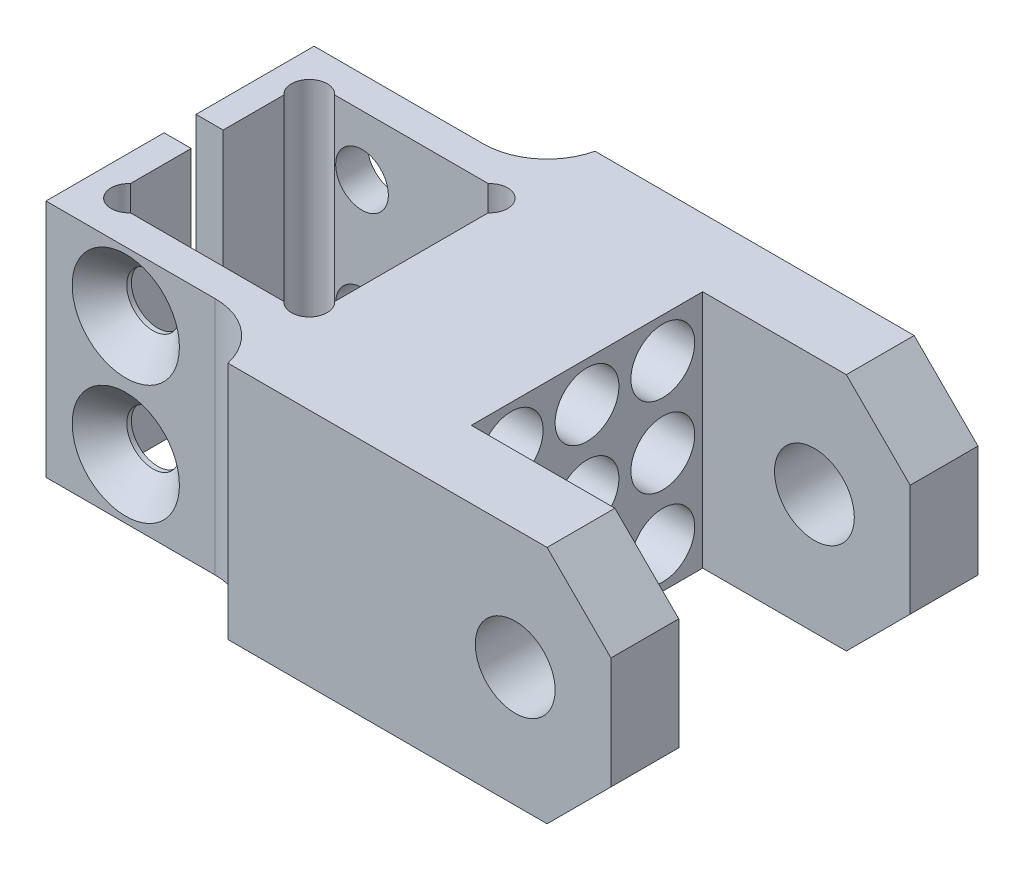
ISO-10303-21;
HEADER;
FILE_DESCRIPTION(('STEP AP214'),'2;1');
FILE_NAME('part.step','',(''),(''),'','','');
FILE_SCHEMA(('AUTOMOTIVE_DESIGN { 1 0 10303 214 1 1 1 1 }'));
ENDSEC;
DATA;
#1=APPLICATION_CONTEXT('core data for automotive mechanical design processes');
#2=APPLICATION_PROTOCOL_DEFINITION('international standard','automotive_design',2000,#1);
#3=PRODUCT_CONTEXT('',#1,'mechanical');
#4=PRODUCT('Part','Part','',(#3));
#5=PRODUCT_RELATED_PRODUCT_CATEGORY('part','',(#4));
#6=PRODUCT_DEFINITION_FORMATION('','',#4);
#7=PRODUCT_DEFINITION_CONTEXT('part definition',#1,'design');
#8=PRODUCT_DEFINITION('design','',#6,#7);
#9=PRODUCT_DEFINITION_SHAPE('','',#8);
#10=(LENGTH_UNIT() NAMED_UNIT(*) SI_UNIT(.MILLI.,.METRE.));
#11=(NAMED_UNIT(*) PLANE_ANGLE_UNIT() SI_UNIT($,.RADIAN.));
#12=(NAMED_UNIT(*) SI_UNIT($,.STERADIAN.) SOLID_ANGLE_UNIT());
#13=UNCERTAINTY_MEASURE_WITH_UNIT(LENGTH_MEASURE(1.E-05),#10,'distance_accuracy_value','');
#14=(GEOMETRIC_REPRESENTATION_CONTEXT(3) GLOBAL_UNCERTAINTY_ASSIGNED_CONTEXT((#13)) GLOBAL_UNIT_ASSIGNED_CONTEXT((#10,
#11,#12)) REPRESENTATION_CONTEXT('',''));
#15=CARTESIAN_POINT('',(0.,0.,0.));
#16=DIRECTION('',(0.,0.,1.));
#17=DIRECTION('',(1.,0.,0.));
#18=AXIS2_PLACEMENT_3D('',#15,#16,#17);
#19=CARTESIAN_POINT('',(42.,0.,0.));
#20=DIRECTION('',(1.,0.,0.));
#21=DIRECTION('',(0.,0.,-1.));
#22=AXIS2_PLACEMENT_3D('',#19,#20,#21);
#23=PLANE('',#22);
#24=DIRECTION('',(0.,-1.,0.));
#25=VECTOR('',#24,1.);
#26=CARTESIAN_POINT('',(42.,15.,23.));
#27=LINE('',#26,#25);
#28=CARTESIAN_POINT('',(42.,6.99999999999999,23.));
#29=VERTEX_POINT('',#28);
#30=CARTESIAN_POINT('',(42.,-6.99999999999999,23.));
#31=VERTEX_POINT('',#30);
#32=EDGE_CURVE('E895',#29,#31,#27,.T.);
#33=ORIENTED_EDGE('',*,*,#32,.T.);
#34=DIRECTION('',(0.,0.,-1.));
#35=VECTOR('',#34,1.);
#36=CARTESIAN_POINT('',(42.,-6.99999999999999,14.5));
#37=LINE('',#36,#35);
#38=CARTESIAN_POINT('',(42.,-6.99999999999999,14.5));
#39=VERTEX_POINT('',#38);
#40=EDGE_CURVE('E947',#31,#39,#37,.T.);
#41=ORIENTED_EDGE('',*,*,#40,.T.);
#42=DIRECTION('',(0.,-1.,0.));
#43=VECTOR('',#42,1.);
#44=CARTESIAN_POINT('',(42.,15.,14.5));
#45=LINE('',#44,#43);
#46=CARTESIAN_POINT('',(42.,6.99999999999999,14.5));
#47=VERTEX_POINT('',#46);
#48=EDGE_CURVE('E441',#47,#39,#45,.T.);
#49=ORIENTED_EDGE('',*,*,#48,.F.);
#50=DIRECTION('',(0.,0.,1.));
#51=VECTOR('',#50,1.);
#52=CARTESIAN_POINT('',(42.,6.99999999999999,23.));
#53=LINE('',#52,#51);
#54=EDGE_CURVE('E937',#47,#29,#53,.T.);
#55=ORIENTED_EDGE('',*,*,#54,.T.);
#56=EDGE_LOOP('',(#33,#41,#49,#55));
#57=FACE_BOUND('',#56,.T.);
#58=ADVANCED_FACE('F40',(#57),#23,.T.);
#59=CARTESIAN_POINT('',(42.,15.,-23.));
#60=DIRECTION('',(0.,0.,1.));
#61=DIRECTION('',(0.,-1.,0.));
#62=AXIS2_PLACEMENT_3D('',#59,#60,#61);
#63=PLANE('',#62);
#64=CARTESIAN_POINT('',(30.,0.,-23.));
#65=DIRECTION('',(0.,0.,1.));
#66=DIRECTION('',(1.,0.,0.));
#67=AXIS2_PLACEMENT_3D('',#64,#65,#66);
#68=CIRCLE('',#67,5.);
#69=CARTESIAN_POINT('',(35.,0.,-23.));
#70=VERTEX_POINT('',#69);
#71=EDGE_CURVE('E943',#70,#70,#68,.T.);
#72=ORIENTED_EDGE('',*,*,#71,.T.);
#73=EDGE_LOOP('',(#72));
#74=FACE_BOUND('',#73,.T.);
#75=DIRECTION('',(0.,1.,0.));
#76=VECTOR('',#75,1.);
#77=CARTESIAN_POINT('',(42.,15.,-23.));
#78=LINE('',#77,#76);
#79=CARTESIAN_POINT('',(42.,-6.99999999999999,-23.));
#80=VERTEX_POINT('',#79);
#81=CARTESIAN_POINT('',(42.,6.99999999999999,-23.));
#82=VERTEX_POINT('',#81);
#83=EDGE_CURVE('E842',#80,#82,#78,.T.);
#84=ORIENTED_EDGE('',*,*,#83,.F.);
#85=DIRECTION('',(-0.707106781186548,-0.707106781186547,0.));
#86=VECTOR('',#85,1.);
#87=CARTESIAN_POINT('',(42.,-6.99999999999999,-23.));
#88=LINE('',#87,#86);
#89=CARTESIAN_POINT('',(34.,-15.,-23.));
#90=VERTEX_POINT('',#89);
#91=EDGE_CURVE('E448',#80,#90,#88,.T.);
#92=ORIENTED_EDGE('',*,*,#91,.T.);
#93=DIRECTION('',(-1.,0.,0.));
#94=VECTOR('',#93,1.);
#95=CARTESIAN_POINT('',(42.,-15.,-23.));
#96=LINE('',#95,#94);
#97=CARTESIAN_POINT('',(-6.,-15.,-23.));
#98=VERTEX_POINT('',#97);
#99=EDGE_CURVE('E898',#90,#98,#96,.T.);
#100=ORIENTED_EDGE('',*,*,#99,.T.);
#101=DIRECTION('',(0.,-1.,0.));
#102=VECTOR('',#101,1.);
#103=CARTESIAN_POINT('',(-6.,15.,-23.));
#104=LINE('',#103,#102);
#105=CARTESIAN_POINT('',(-6.,15.,-23.));
#106=VERTEX_POINT('',#105);
#107=EDGE_CURVE('E884',#106,#98,#104,.T.);
#108=ORIENTED_EDGE('',*,*,#107,.F.);
#109=DIRECTION('',(-1.,0.,0.));
#110=VECTOR('',#109,1.);
#111=CARTESIAN_POINT('',(42.,15.,-23.));
#112=LINE('',#111,#110);
#113=CARTESIAN_POINT('',(34.,15.,-23.));
#114=VERTEX_POINT('',#113);
#115=EDGE_CURVE('E907',#114,#106,#112,.T.);
#116=ORIENTED_EDGE('',*,*,#115,.F.);
#117=DIRECTION('',(0.707106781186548,-0.707106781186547,0.));
#118=VECTOR('',#117,1.);
#119=CARTESIAN_POINT('',(42.,6.99999999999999,-23.));
#120=LINE('',#119,#118);
#121=EDGE_CURVE('E450',#114,#82,#120,.T.);
#122=ORIENTED_EDGE('',*,*,#121,.T.);
#123=EDGE_LOOP('',(#84,#92,#100,#108,#116,#122));
#124=FACE_BOUND('',#123,.T.);
#125=ADVANCED_FACE('F404',(#74,#124),#63,.F.);
#126=CARTESIAN_POINT('',(42.,15.,23.));
#127=DIRECTION('',(0.,-1.,0.));
#128=DIRECTION('',(0.,0.,-1.));
#129=AXIS2_PLACEMENT_3D('',#126,#127,#128);
#130=PLANE('',#129);
#131=DIRECTION('',(1.,0.,0.));
#132=VECTOR('',#131,1.);
#133=CARTESIAN_POINT('',(16.,15.,-14.5));
#134=LINE('',#133,#132);
#135=CARTESIAN_POINT('',(16.,15.,-14.5));
#136=VERTEX_POINT('',#135);
#137=CARTESIAN_POINT('',(34.,15.,-14.5));
#138=VERTEX_POINT('',#137);
#139=EDGE_CURVE('E683',#136,#138,#134,.T.);
#140=ORIENTED_EDGE('',*,*,#139,.T.);
#141=DIRECTION('',(0.,0.,-1.));
#142=VECTOR('',#141,1.);
#143=CARTESIAN_POINT('',(34.,15.,-23.));
#144=LINE('',#143,#142);
#145=EDGE_CURVE('E470',#138,#114,#144,.T.);
#146=ORIENTED_EDGE('',*,*,#145,.T.);
#147=ORIENTED_EDGE('',*,*,#115,.T.);
#148=CARTESIAN_POINT('',(-13.794870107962,15.,-24.8));
#149=DIRECTION('',(0.,-1.,0.));
#150=DIRECTION('',(0.,0.,-1.));
#151=AXIS2_PLACEMENT_3D('',#148,#149,#150);
#152=CIRCLE('',#151,8.);
#153=CARTESIAN_POINT('',(-13.794870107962,15.,-16.8));
#154=VERTEX_POINT('',#153);
#155=EDGE_CURVE('E927',#106,#154,#152,.T.);
#156=ORIENTED_EDGE('',*,*,#155,.T.);
#157=DIRECTION('',(1.,0.,0.));
#158=VECTOR('',#157,1.);
#159=CARTESIAN_POINT('',(-35.,15.,-16.8));
#160=LINE('',#159,#158);
#161=CARTESIAN_POINT('',(-35.,15.,-16.8));
#162=VERTEX_POINT('',#161);
#163=EDGE_CURVE('E733',#162,#154,#160,.T.);
#164=ORIENTED_EDGE('',*,*,#163,.F.);
#165=DIRECTION('',(0.,0.,-1.));
#166=VECTOR('',#165,1.);
#167=CARTESIAN_POINT('',(-35.,15.,-1.99999999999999));
#168=LINE('',#167,#166);
#169=CARTESIAN_POINT('',(-35.,15.,-1.99999999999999));
#170=VERTEX_POINT('',#169);
#171=EDGE_CURVE('E728',#170,#162,#168,.T.);
#172=ORIENTED_EDGE('',*,*,#171,.F.);
#173=DIRECTION('',(-1.,0.,0.));
#174=VECTOR('',#173,1.);
#175=CARTESIAN_POINT('',(-31.6,15.,-1.99999999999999));
#176=LINE('',#175,#174);
#177=CARTESIAN_POINT('',(-31.6,15.,-1.99999999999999));
#178=VERTEX_POINT('',#177);
#179=EDGE_CURVE('E724',#178,#170,#176,.T.);
#180=ORIENTED_EDGE('',*,*,#179,.F.);
#181=DIRECTION('',(0.,0.,1.));
#182=VECTOR('',#181,1.);
#183=CARTESIAN_POINT('',(-31.6,15.,-9.62294901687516));
#184=LINE('',#183,#182);
#185=CARTESIAN_POINT('',(-31.6,15.,-9.62294901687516));
#186=VERTEX_POINT('',#185);
#187=EDGE_CURVE('E777',#186,#178,#184,.T.);
#188=ORIENTED_EDGE('',*,*,#187,.F.);
#189=CARTESIAN_POINT('',(-30.1,15.,-11.3));
#190=DIRECTION('',(0.,1.,0.));
#191=DIRECTION('',(0.,0.,1.));
#192=AXIS2_PLACEMENT_3D('',#189,#190,#191);
#193=CIRCLE('',#192,2.25);
#194=CARTESIAN_POINT('',(-28.4229490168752,15.,-12.8));
#195=VERTEX_POINT('',#194);
#196=EDGE_CURVE('E773',#195,#186,#193,.T.);
#197=ORIENTED_EDGE('',*,*,#196,.F.);
#198=DIRECTION('',(1.,0.,0.));
#199=VECTOR('',#198,1.);
#200=CARTESIAN_POINT('',(-28.4229490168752,15.,-12.8));
#201=LINE('',#200,#199);
#202=CARTESIAN_POINT('',(-9.17705098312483,15.,-12.8));
#203=VERTEX_POINT('',#202);
#204=EDGE_CURVE('E770',#195,#203,#201,.T.);
#205=ORIENTED_EDGE('',*,*,#204,.T.);
#206=CARTESIAN_POINT('',(-7.49999999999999,15.,-11.3));
#207=DIRECTION('',(0.,1.,0.));
#208=DIRECTION('',(0.,0.,1.));
#209=AXIS2_PLACEMENT_3D('',#206,#207,#208);
#210=CIRCLE('',#209,2.25);
#211=CARTESIAN_POINT('',(-6.,15.,-9.62294901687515));
#212=VERTEX_POINT('',#211);
#213=EDGE_CURVE('E766',#212,#203,#210,.T.);
#214=ORIENTED_EDGE('',*,*,#213,.F.);
#215=DIRECTION('',(0.,0.,1.));
#216=VECTOR('',#215,1.);
#217=CARTESIAN_POINT('',(-6.,15.,-9.62294901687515));
#218=LINE('',#217,#216);
#219=CARTESIAN_POINT('',(-6.,15.,9.62294901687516));
#220=VERTEX_POINT('',#219);
#221=EDGE_CURVE('E763',#212,#220,#218,.T.);
#222=ORIENTED_EDGE('',*,*,#221,.T.);
#223=CARTESIAN_POINT('',(-7.49999999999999,15.,11.3));
#224=DIRECTION('',(0.,1.,0.));
#225=DIRECTION('',(0.,0.,1.));
#226=AXIS2_PLACEMENT_3D('',#223,#224,#225);
#227=CIRCLE('',#226,2.25);
#228=CARTESIAN_POINT('',(-9.17705098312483,15.,12.8));
#229=VERTEX_POINT('',#228);
#230=EDGE_CURVE('E760',#229,#220,#227,.T.);
#231=ORIENTED_EDGE('',*,*,#230,.F.);
#232=DIRECTION('',(1.,0.,0.));
#233=VECTOR('',#232,1.);
#234=CARTESIAN_POINT('',(-28.4229490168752,15.,12.8));
#235=LINE('',#234,#233);
#236=CARTESIAN_POINT('',(-28.4229490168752,15.,12.8));
#237=VERTEX_POINT('',#236);
#238=EDGE_CURVE('E756',#237,#229,#235,.T.);
#239=ORIENTED_EDGE('',*,*,#238,.F.);
#240=CARTESIAN_POINT('',(-30.1,15.,11.3));
#241=DIRECTION('',(0.,1.,0.));
#242=DIRECTION('',(0.,0.,1.));
#243=AXIS2_PLACEMENT_3D('',#240,#241,#242);
#244=CIRCLE('',#243,2.25);
#245=CARTESIAN_POINT('',(-31.6,15.,9.62294901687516));
#246=VERTEX_POINT('',#245);
#247=EDGE_CURVE('E752',#246,#237,#244,.T.);
#248=ORIENTED_EDGE('',*,*,#247,.F.);
#249=DIRECTION('',(0.,0.,1.));
#250=VECTOR('',#249,1.);
#251=CARTESIAN_POINT('',(-31.6,15.,2.00000000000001));
#252=LINE('',#251,#250);
#253=CARTESIAN_POINT('',(-31.6,15.,2.00000000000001));
#254=VERTEX_POINT('',#253);
#255=EDGE_CURVE('E748',#254,#246,#252,.T.);
#256=ORIENTED_EDGE('',*,*,#255,.F.);
#257=DIRECTION('',(1.,0.,0.));
#258=VECTOR('',#257,1.);
#259=CARTESIAN_POINT('',(-35.,15.,2.00000000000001));
#260=LINE('',#259,#258);
#261=CARTESIAN_POINT('',(-35.,15.,2.00000000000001));
#262=VERTEX_POINT('',#261);
#263=EDGE_CURVE('E744',#262,#254,#260,.T.);
#264=ORIENTED_EDGE('',*,*,#263,.F.);
#265=DIRECTION('',(0.,0.,-1.));
#266=VECTOR('',#265,1.);
#267=CARTESIAN_POINT('',(-35.,15.,16.8));
#268=LINE('',#267,#266);
#269=CARTESIAN_POINT('',(-35.,15.,16.8));
#270=VERTEX_POINT('',#269);
#271=EDGE_CURVE('E740',#270,#262,#268,.T.);
#272=ORIENTED_EDGE('',*,*,#271,.F.);
#273=DIRECTION('',(-1.,0.,0.));
#274=VECTOR('',#273,1.);
#275=CARTESIAN_POINT('',(-6.,15.,16.8));
#276=LINE('',#275,#274);
#277=CARTESIAN_POINT('',(-13.794870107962,15.,16.8));
#278=VERTEX_POINT('',#277);
#279=EDGE_CURVE('E737',#278,#270,#276,.T.);
#280=ORIENTED_EDGE('',*,*,#279,.F.);
#281=CARTESIAN_POINT('',(-13.794870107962,15.,24.8));
#282=DIRECTION('',(0.,-1.,0.));
#283=DIRECTION('',(0.,0.,-1.));
#284=AXIS2_PLACEMENT_3D('',#281,#282,#283);
#285=CIRCLE('',#284,8.);
#286=CARTESIAN_POINT('',(-6.,15.,23.));
#287=VERTEX_POINT('',#286);
#288=EDGE_CURVE('E933',#278,#287,#285,.T.);
#289=ORIENTED_EDGE('',*,*,#288,.T.);
#290=DIRECTION('',(-1.,0.,0.));
#291=VECTOR('',#290,1.);
#292=CARTESIAN_POINT('',(42.,15.,23.));
#293=LINE('',#292,#291);
#294=CARTESIAN_POINT('',(34.,15.,23.));
#295=VERTEX_POINT('',#294);
#296=EDGE_CURVE('E904',#295,#287,#293,.T.);
#297=ORIENTED_EDGE('',*,*,#296,.F.);
#298=DIRECTION('',(0.,0.,-1.));
#299=VECTOR('',#298,1.);
#300=CARTESIAN_POINT('',(34.,15.,14.5));
#301=LINE('',#300,#299);
#302=CARTESIAN_POINT('',(34.,15.,14.5));
#303=VERTEX_POINT('',#302);
#304=EDGE_CURVE('E467',#295,#303,#301,.T.);
#305=ORIENTED_EDGE('',*,*,#304,.T.);
#306=DIRECTION('',(1.,0.,0.));
#307=VECTOR('',#306,1.);
#308=CARTESIAN_POINT('',(16.,15.,14.5));
#309=LINE('',#308,#307);
#310=CARTESIAN_POINT('',(16.,15.,14.5));
#311=VERTEX_POINT('',#310);
#312=EDGE_CURVE('E679',#311,#303,#309,.T.);
#313=ORIENTED_EDGE('',*,*,#312,.F.);
#314=DIRECTION('',(0.,0.,1.));
#315=VECTOR('',#314,1.);
#316=CARTESIAN_POINT('',(16.,15.,14.5));
#317=LINE('',#316,#315);
#318=EDGE_CURVE('E654',#136,#311,#317,.T.);
#319=ORIENTED_EDGE('',*,*,#318,.F.);
#320=EDGE_LOOP('',(#140,#146,#147,#156,#164,#172,#180,#188,#197,#205,#214,#222,#231,#239,#248,
#256,#264,#272,#280,#289,#297,#305,#313,#319));
#321=FACE_BOUND('',#320,.T.);
#322=ADVANCED_FACE('F411',(#321),#130,.F.);
#323=CARTESIAN_POINT('',(42.,15.,23.));
#324=DIRECTION('',(0.,0.,-1.));
#325=DIRECTION('',(0.,1.,0.));
#326=AXIS2_PLACEMENT_3D('',#323,#324,#325);
#327=PLANE('',#326);
#328=CARTESIAN_POINT('',(30.,0.,23.));
#329=DIRECTION('',(0.,0.,-1.));
#330=DIRECTION('',(0.,1.,0.));
#331=AXIS2_PLACEMENT_3D('',#328,#329,#330);
#332=CIRCLE('',#331,5.);
#333=CARTESIAN_POINT('',(30.,5.,23.));
#334=VERTEX_POINT('',#333);
#335=EDGE_CURVE('E677',#334,#334,#332,.T.);
#336=ORIENTED_EDGE('',*,*,#335,.T.);
#337=EDGE_LOOP('',(#336));
#338=FACE_BOUND('',#337,.T.);
#339=DIRECTION('',(-1.,0.,0.));
#340=VECTOR('',#339,1.);
#341=CARTESIAN_POINT('',(42.,-15.,23.));
#342=LINE('',#341,#340);
#343=CARTESIAN_POINT('',(34.,-15.,23.));
#344=VERTEX_POINT('',#343);
#345=CARTESIAN_POINT('',(-6.,-15.,23.));
#346=VERTEX_POINT('',#345);
#347=EDGE_CURVE('E901',#344,#346,#342,.T.);
#348=ORIENTED_EDGE('',*,*,#347,.F.);
#349=DIRECTION('',(0.707106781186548,0.707106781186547,0.));
#350=VECTOR('',#349,1.);
#351=CARTESIAN_POINT('',(42.,-6.99999999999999,23.));
#352=LINE('',#351,#350);
#353=EDGE_CURVE('E456',#344,#31,#352,.T.);
#354=ORIENTED_EDGE('',*,*,#353,.T.);
#355=ORIENTED_EDGE('',*,*,#32,.F.);
#356=DIRECTION('',(-0.707106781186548,0.707106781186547,0.));
#357=VECTOR('',#356,1.);
#358=CARTESIAN_POINT('',(42.,6.99999999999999,23.));
#359=LINE('',#358,#357);
#360=EDGE_CURVE('E963',#29,#295,#359,.T.);
#361=ORIENTED_EDGE('',*,*,#360,.T.);
#362=ORIENTED_EDGE('',*,*,#296,.T.);
#363=DIRECTION('',(0.,-1.,0.));
#364=VECTOR('',#363,1.);
#365=CARTESIAN_POINT('',(-6.,15.,23.));
#366=LINE('',#365,#364);
#367=EDGE_CURVE('E880',#287,#346,#366,.T.);
#368=ORIENTED_EDGE('',*,*,#367,.T.);
#369=EDGE_LOOP('',(#348,#354,#355,#361,#362,#368));
#370=FACE_BOUND('',#369,.T.);
#371=ADVANCED_FACE('F425',(#338,#370),#327,.F.);
#372=CARTESIAN_POINT('',(42.,-15.,23.));
#373=DIRECTION('',(0.,1.,0.));
#374=DIRECTION('',(0.,0.,1.));
#375=AXIS2_PLACEMENT_3D('',#372,#373,#374);
#376=PLANE('',#375);
#377=DIRECTION('',(1.,0.,0.));
#378=VECTOR('',#377,1.);
#379=CARTESIAN_POINT('',(16.,-15.,14.5));
#380=LINE('',#379,#378);
#381=CARTESIAN_POINT('',(16.,-15.,14.5));
#382=VERTEX_POINT('',#381);
#383=CARTESIAN_POINT('',(34.,-15.,14.5));
#384=VERTEX_POINT('',#383);
#385=EDGE_CURVE('E661',#382,#384,#380,.T.);
#386=ORIENTED_EDGE('',*,*,#385,.T.);
#387=DIRECTION('',(0.,0.,1.));
#388=VECTOR('',#387,1.);
#389=CARTESIAN_POINT('',(34.,-15.,23.));
#390=LINE('',#389,#388);
#391=EDGE_CURVE('E960',#384,#344,#390,.T.);
#392=ORIENTED_EDGE('',*,*,#391,.T.);
#393=ORIENTED_EDGE('',*,*,#347,.T.);
#394=CARTESIAN_POINT('',(-13.794870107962,-15.,24.8));
#395=DIRECTION('',(0.,1.,0.));
#396=DIRECTION('',(0.,0.,1.));
#397=AXIS2_PLACEMENT_3D('',#394,#395,#396);
#398=CIRCLE('',#397,8.);
#399=CARTESIAN_POINT('',(-13.794870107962,-15.,16.8));
#400=VERTEX_POINT('',#399);
#401=EDGE_CURVE('E930',#346,#400,#398,.T.);
#402=ORIENTED_EDGE('',*,*,#401,.T.);
#403=DIRECTION('',(-1.,0.,0.));
#404=VECTOR('',#403,1.);
#405=CARTESIAN_POINT('',(-6.,-15.,16.8));
#406=LINE('',#405,#404);
#407=CARTESIAN_POINT('',(-35.,-15.,16.8));
#408=VERTEX_POINT('',#407);
#409=EDGE_CURVE('E793',#400,#408,#406,.T.);
#410=ORIENTED_EDGE('',*,*,#409,.T.);
#411=DIRECTION('',(0.,0.,-1.));
#412=VECTOR('',#411,1.);
#413=CARTESIAN_POINT('',(-35.,-15.,16.8));
#414=LINE('',#413,#412);
#415=CARTESIAN_POINT('',(-35.,-15.,2.00000000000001));
#416=VERTEX_POINT('',#415);
#417=EDGE_CURVE('E796',#408,#416,#414,.T.);
#418=ORIENTED_EDGE('',*,*,#417,.T.);
#419=DIRECTION('',(1.,0.,0.));
#420=VECTOR('',#419,1.);
#421=CARTESIAN_POINT('',(-35.,-15.,2.00000000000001));
#422=LINE('',#421,#420);
#423=CARTESIAN_POINT('',(-31.6,-15.,2.00000000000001));
#424=VERTEX_POINT('',#423);
#425=EDGE_CURVE('E800',#416,#424,#422,.T.);
#426=ORIENTED_EDGE('',*,*,#425,.T.);
#427=DIRECTION('',(0.,0.,1.));
#428=VECTOR('',#427,1.);
#429=CARTESIAN_POINT('',(-31.6,-15.,2.00000000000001));
#430=LINE('',#429,#428);
#431=CARTESIAN_POINT('',(-31.6,-15.,9.62294901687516));
#432=VERTEX_POINT('',#431);
#433=EDGE_CURVE('E804',#424,#432,#430,.T.);
#434=ORIENTED_EDGE('',*,*,#433,.T.);
#435=CARTESIAN_POINT('',(-30.1,-15.,11.3));
#436=DIRECTION('',(0.,1.,0.));
#437=DIRECTION('',(0.,0.,1.));
#438=AXIS2_PLACEMENT_3D('',#435,#436,#437);
#439=CIRCLE('',#438,2.25);
#440=CARTESIAN_POINT('',(-28.4229490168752,-15.,12.8));
#441=VERTEX_POINT('',#440);
#442=EDGE_CURVE('E808',#432,#441,#439,.T.);
#443=ORIENTED_EDGE('',*,*,#442,.T.);
#444=DIRECTION('',(1.,0.,0.));
#445=VECTOR('',#444,1.);
#446=CARTESIAN_POINT('',(-28.4229490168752,-15.,12.8));
#447=LINE('',#446,#445);
#448=CARTESIAN_POINT('',(-9.17705098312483,-15.,12.8));
#449=VERTEX_POINT('',#448);
#450=EDGE_CURVE('E812',#441,#449,#447,.T.);
#451=ORIENTED_EDGE('',*,*,#450,.T.);
#452=CARTESIAN_POINT('',(-7.49999999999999,-15.,11.3));
#453=DIRECTION('',(0.,1.,0.));
#454=DIRECTION('',(0.,0.,1.));
#455=AXIS2_PLACEMENT_3D('',#452,#453,#454);
#456=CIRCLE('',#455,2.25);
#457=CARTESIAN_POINT('',(-6.,-15.,9.62294901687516));
#458=VERTEX_POINT('',#457);
#459=EDGE_CURVE('E816',#449,#458,#456,.T.);
#460=ORIENTED_EDGE('',*,*,#459,.T.);
#461=DIRECTION('',(0.,0.,1.));
#462=VECTOR('',#461,1.);
#463=CARTESIAN_POINT('',(-6.,-15.,-9.62294901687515));
#464=LINE('',#463,#462);
#465=CARTESIAN_POINT('',(-6.,-15.,-9.62294901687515));
#466=VERTEX_POINT('',#465);
#467=EDGE_CURVE('E820',#466,#458,#464,.T.);
#468=ORIENTED_EDGE('',*,*,#467,.F.);
#469=CARTESIAN_POINT('',(-7.49999999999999,-15.,-11.3));
#470=DIRECTION('',(0.,1.,0.));
#471=DIRECTION('',(0.,0.,1.));
#472=AXIS2_PLACEMENT_3D('',#469,#470,#471);
#473=CIRCLE('',#472,2.25);
#474=CARTESIAN_POINT('',(-9.17705098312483,-15.,-12.8));
#475=VERTEX_POINT('',#474);
#476=EDGE_CURVE('E824',#466,#475,#473,.T.);
#477=ORIENTED_EDGE('',*,*,#476,.T.);
#478=DIRECTION('',(1.,0.,0.));
#479=VECTOR('',#478,1.);
#480=CARTESIAN_POINT('',(-28.4229490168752,-15.,-12.8));
#481=LINE('',#480,#479);
#482=CARTESIAN_POINT('',(-28.4229490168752,-15.,-12.8));
#483=VERTEX_POINT('',#482);
#484=EDGE_CURVE('E828',#483,#475,#481,.T.);
#485=ORIENTED_EDGE('',*,*,#484,.F.);
#486=CARTESIAN_POINT('',(-30.1,-15.,-11.3));
#487=DIRECTION('',(0.,1.,0.));
#488=DIRECTION('',(0.,0.,1.));
#489=AXIS2_PLACEMENT_3D('',#486,#487,#488);
#490=CIRCLE('',#489,2.25);
#491=CARTESIAN_POINT('',(-31.6,-15.,-9.62294901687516));
#492=VERTEX_POINT('',#491);
#493=EDGE_CURVE('E832',#483,#492,#490,.T.);
#494=ORIENTED_EDGE('',*,*,#493,.T.);
#495=DIRECTION('',(0.,0.,1.));
#496=VECTOR('',#495,1.);
#497=CARTESIAN_POINT('',(-31.6,-15.,-9.62294901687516));
#498=LINE('',#497,#496);
#499=CARTESIAN_POINT('',(-31.6,-15.,-1.99999999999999));
#500=VERTEX_POINT('',#499);
#501=EDGE_CURVE('E729',#492,#500,#498,.T.);
#502=ORIENTED_EDGE('',*,*,#501,.T.);
#503=DIRECTION('',(-1.,0.,0.));
#504=VECTOR('',#503,1.);
#505=CARTESIAN_POINT('',(-31.6,-15.,-1.99999999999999));
#506=LINE('',#505,#504);
#507=CARTESIAN_POINT('',(-35.,-15.,-1.99999999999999));
#508=VERTEX_POINT('',#507);
#509=EDGE_CURVE('E723',#500,#508,#506,.T.);
#510=ORIENTED_EDGE('',*,*,#509,.T.);
#511=DIRECTION('',(0.,0.,-1.));
#512=VECTOR('',#511,1.);
#513=CARTESIAN_POINT('',(-35.,-15.,-1.99999999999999));
#514=LINE('',#513,#512);
#515=CARTESIAN_POINT('',(-35.,-15.,-16.8));
#516=VERTEX_POINT('',#515);
#517=EDGE_CURVE('E785',#508,#516,#514,.T.);
#518=ORIENTED_EDGE('',*,*,#517,.T.);
#519=DIRECTION('',(1.,0.,0.));
#520=VECTOR('',#519,1.);
#521=CARTESIAN_POINT('',(-35.,-15.,-16.8));
#522=LINE('',#521,#520);
#523=CARTESIAN_POINT('',(-13.794870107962,-15.,-16.8));
#524=VERTEX_POINT('',#523);
#525=EDGE_CURVE('E789',#516,#524,#522,.T.);
#526=ORIENTED_EDGE('',*,*,#525,.T.);
#527=CARTESIAN_POINT('',(-13.794870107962,-15.,-24.8));
#528=DIRECTION('',(0.,1.,0.));
#529=DIRECTION('',(0.,0.,1.));
#530=AXIS2_PLACEMENT_3D('',#527,#528,#529);
#531=CIRCLE('',#530,8.);
#532=EDGE_CURVE('E923',#524,#98,#531,.T.);
#533=ORIENTED_EDGE('',*,*,#532,.T.);
#534=ORIENTED_EDGE('',*,*,#99,.F.);
#535=DIRECTION('',(0.,0.,1.));
#536=VECTOR('',#535,1.);
#537=CARTESIAN_POINT('',(34.,-15.,-14.5));
#538=LINE('',#537,#536);
#539=CARTESIAN_POINT('',(34.,-15.,-14.5));
#540=VERTEX_POINT('',#539);
#541=EDGE_CURVE('E957',#90,#540,#538,.T.);
#542=ORIENTED_EDGE('',*,*,#541,.T.);
#543=DIRECTION('',(1.,0.,0.));
#544=VECTOR('',#543,1.);
#545=CARTESIAN_POINT('',(16.,-15.,-14.5));
#546=LINE('',#545,#544);
#547=CARTESIAN_POINT('',(16.,-15.,-14.5));
#548=VERTEX_POINT('',#547);
#549=EDGE_CURVE('E664',#548,#540,#546,.T.);
#550=ORIENTED_EDGE('',*,*,#549,.F.);
#551=DIRECTION('',(0.,0.,-1.));
#552=VECTOR('',#551,1.);
#553=CARTESIAN_POINT('',(16.,-15.,14.5));
#554=LINE('',#553,#552);
#555=EDGE_CURVE('E651',#382,#548,#554,.T.);
#556=ORIENTED_EDGE('',*,*,#555,.F.);
#557=EDGE_LOOP('',(#386,#392,#393,#402,#410,#418,#426,#434,#443,#451,#460,#468,#477,#485,#494,
#502,#510,#518,#526,#533,#534,#542,#550,#556));
#558=FACE_BOUND('',#557,.T.);
#559=ADVANCED_FACE('F418',(#558),#376,.F.);
#560=DIRECTION('',(0.,1.,0.));
#561=VECTOR('',#560,1.);
#562=CARTESIAN_POINT('',(42.,15.,-14.5));
#563=LINE('',#562,#561);
#564=CARTESIAN_POINT('',(42.,-6.99999999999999,-14.5));
#565=VERTEX_POINT('',#564);
#566=CARTESIAN_POINT('',(42.,6.99999999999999,-14.5));
#567=VERTEX_POINT('',#566);
#568=EDGE_CURVE('E431',#565,#567,#563,.T.);
#569=ORIENTED_EDGE('',*,*,#568,.F.);
#570=DIRECTION('',(0.,0.,-1.));
#571=VECTOR('',#570,1.);
#572=CARTESIAN_POINT('',(42.,-6.99999999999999,-23.));
#573=LINE('',#572,#571);
#574=EDGE_CURVE('E434',#565,#80,#573,.T.);
#575=ORIENTED_EDGE('',*,*,#574,.T.);
#576=ORIENTED_EDGE('',*,*,#83,.T.);
#577=DIRECTION('',(0.,0.,1.));
#578=VECTOR('',#577,1.);
#579=CARTESIAN_POINT('',(42.,6.99999999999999,-14.5));
#580=LINE('',#579,#578);
#581=EDGE_CURVE('E437',#82,#567,#580,.T.);
#582=ORIENTED_EDGE('',*,*,#581,.T.);
#583=EDGE_LOOP('',(#569,#575,#576,#582));
#584=FACE_BOUND('',#583,.T.);
#585=ADVANCED_FACE('F407',(#584),#23,.T.);
#586=CARTESIAN_POINT('',(-31.6,15.,-1.99999999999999));
#587=DIRECTION('',(0.,0.,1.));
#588=DIRECTION('',(1.,0.,0.));
#589=AXIS2_PLACEMENT_3D('',#586,#587,#588);
#590=PLANE('',#589);
#591=ORIENTED_EDGE('',*,*,#509,.F.);
#592=DIRECTION('',(0.,-1.,0.));
#593=VECTOR('',#592,1.);
#594=CARTESIAN_POINT('',(-31.6,15.,-1.99999999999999));
#595=LINE('',#594,#593);
#596=EDGE_CURVE('E839',#178,#500,#595,.T.);
#597=ORIENTED_EDGE('',*,*,#596,.F.);
#598=ORIENTED_EDGE('',*,*,#179,.T.);
#599=DIRECTION('',(0.,-1.,0.));
#600=VECTOR('',#599,1.);
#601=CARTESIAN_POINT('',(-35.,15.,-1.99999999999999));
#602=LINE('',#601,#600);
#603=EDGE_CURVE('E781',#170,#508,#602,.T.);
#604=ORIENTED_EDGE('',*,*,#603,.T.);
#605=EDGE_LOOP('',(#591,#597,#598,#604));
#606=FACE_BOUND('',#605,.T.);
#607=ADVANCED_FACE('F390',(#606),#590,.T.);
#608=CARTESIAN_POINT('',(-31.6,15.,-9.62294901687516));
#609=DIRECTION('',(1.,0.,0.));
#610=DIRECTION('',(0.,0.,-1.));
#611=AXIS2_PLACEMENT_3D('',#608,#609,#610);
#612=PLANE('',#611);
#613=ORIENTED_EDGE('',*,*,#501,.F.);
#614=DIRECTION('',(0.,-1.,0.));
#615=VECTOR('',#614,1.);
#616=CARTESIAN_POINT('',(-31.6,15.,-9.62294901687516));
#617=LINE('',#616,#615);
#618=EDGE_CURVE('E843',#186,#492,#617,.T.);
#619=ORIENTED_EDGE('',*,*,#618,.F.);
#620=ORIENTED_EDGE('',*,*,#187,.T.);
#621=ORIENTED_EDGE('',*,*,#596,.T.);
#622=EDGE_LOOP('',(#613,#619,#620,#621));
#623=FACE_BOUND('',#622,.T.);
#624=ADVANCED_FACE('F386',(#623),#612,.T.);
#625=CARTESIAN_POINT('',(-30.1,15.,-11.3));
#626=DIRECTION('',(0.,-1.,0.));
#627=DIRECTION('',(0.,0.,-1.));
#628=AXIS2_PLACEMENT_3D('',#625,#626,#627);
#629=CYLINDRICAL_SURFACE('',#628,2.25);
#630=ORIENTED_EDGE('',*,*,#493,.F.);
#631=DIRECTION('',(0.,-1.,0.));
#632=VECTOR('',#631,1.);
#633=CARTESIAN_POINT('',(-28.4229490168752,15.,-12.8));
#634=LINE('',#633,#632);
#635=EDGE_CURVE('E846',#195,#483,#634,.T.);
#636=ORIENTED_EDGE('',*,*,#635,.F.);
#637=ORIENTED_EDGE('',*,*,#196,.T.);
#638=ORIENTED_EDGE('',*,*,#618,.T.);
#639=EDGE_LOOP('',(#630,#636,#637,#638));
#640=FACE_BOUND('',#639,.T.);
#641=ADVANCED_FACE('F389',(#640),#629,.F.);
#642=CARTESIAN_POINT('',(-28.4229490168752,15.,-12.8));
#643=DIRECTION('',(0.,0.,-1.));
#644=DIRECTION('',(-1.,0.,0.));
#645=AXIS2_PLACEMENT_3D('',#642,#643,#644);
#646=PLANE('',#645);
#647=CARTESIAN_POINT('',(-25.,7.5,-12.8));
#648=DIRECTION('',(0.,0.,-1.));
#649=DIRECTION('',(-1.,0.,0.));
#650=AXIS2_PLACEMENT_3D('',#647,#648,#649);
#651=CIRCLE('',#650,3.29999999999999);
#652=CARTESIAN_POINT('',(-28.3,7.5,-12.8));
#653=VERTEX_POINT('',#652);
#654=EDGE_CURVE('E699',#653,#653,#651,.T.);
#655=ORIENTED_EDGE('',*,*,#654,.T.);
#656=EDGE_LOOP('',(#655));
#657=FACE_BOUND('',#656,.T.);
#658=CARTESIAN_POINT('',(-25.,-7.5,-12.8));
#659=DIRECTION('',(0.,0.,-1.));
#660=DIRECTION('',(-1.,0.,0.));
#661=AXIS2_PLACEMENT_3D('',#658,#659,#660);
#662=CIRCLE('',#661,3.29999999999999);
#663=CARTESIAN_POINT('',(-28.3,-7.5,-12.8));
#664=VERTEX_POINT('',#663);
#665=EDGE_CURVE('E719',#664,#664,#662,.T.);
#666=ORIENTED_EDGE('',*,*,#665,.T.);
#667=EDGE_LOOP('',(#666));
#668=FACE_BOUND('',#667,.T.);
#669=ORIENTED_EDGE('',*,*,#484,.T.);
#670=DIRECTION('',(0.,-1.,0.));
#671=VECTOR('',#670,1.);
#672=CARTESIAN_POINT('',(-9.17705098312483,15.,-12.8));
#673=LINE('',#672,#671);
#674=EDGE_CURVE('E849',#203,#475,#673,.T.);
#675=ORIENTED_EDGE('',*,*,#674,.F.);
#676=ORIENTED_EDGE('',*,*,#204,.F.);
#677=ORIENTED_EDGE('',*,*,#635,.T.);
#678=EDGE_LOOP('',(#669,#675,#676,#677));
#679=FACE_BOUND('',#678,.T.);
#680=ADVANCED_FACE('F393',(#657,#668,#679),#646,.F.);
#681=CARTESIAN_POINT('',(-7.49999999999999,15.,-11.3));
#682=DIRECTION('',(0.,-1.,0.));
#683=DIRECTION('',(0.,0.,-1.));
#684=AXIS2_PLACEMENT_3D('',#681,#682,#683);
#685=CYLINDRICAL_SURFACE('',#684,2.25);
#686=CARTESIAN_POINT('',(-6.,13.9981099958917,-9.62294901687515));
#687=CARTESIAN_POINT('',(-5.95642623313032,13.9969132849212,-9.6619127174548));
#688=CARTESIAN_POINT('',(-5.91438719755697,13.995091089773,-9.70257953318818));
#689=CARTESIAN_POINT('',(-5.83363179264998,13.9899134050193,-9.78701542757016));
#690=CARTESIAN_POINT('',(-5.79491623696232,13.9865575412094,-9.83078526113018));
#691=CARTESIAN_POINT('',(-5.72109304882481,13.9780317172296,-9.92109102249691));
#692=CARTESIAN_POINT('',(-5.68598439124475,13.9728622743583,-9.96762615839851));
#693=CARTESIAN_POINT('',(-5.61960351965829,13.9604639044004,-10.0630705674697));
#694=CARTESIAN_POINT('',(-5.58833087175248,13.9532352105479,-10.1119795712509));
#695=CARTESIAN_POINT('',(-5.50043802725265,13.9280700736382,-10.261903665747));
#696=CARTESIAN_POINT('',(-5.44984680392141,13.9066650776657,-10.365988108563));
#697=CARTESIAN_POINT('',(-5.36587446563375,13.8535055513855,-10.5781702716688));
#698=CARTESIAN_POINT('',(-5.33247635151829,13.8217612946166,-10.686263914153));
#699=CARTESIAN_POINT('',(-5.28315071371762,13.7485937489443,-10.9001876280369));
#700=CARTESIAN_POINT('',(-5.2668358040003,13.7074121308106,-11.0060120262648));
#701=CARTESIAN_POINT('',(-5.24917059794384,13.6156010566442,-11.2147763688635));
#702=CARTESIAN_POINT('',(-5.24783067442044,13.5649650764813,-11.3177142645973));
#703=CARTESIAN_POINT('',(-5.25876979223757,13.4511265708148,-11.5260516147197));
#704=CARTESIAN_POINT('',(-5.27211095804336,13.3872547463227,-11.6310249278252));
#705=CARTESIAN_POINT('',(-5.31161436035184,13.2514643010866,-11.8329877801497));
#706=CARTESIAN_POINT('',(-5.33778402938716,13.1795410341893,-11.9299726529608));
#707=CARTESIAN_POINT('',(-5.41853402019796,12.9860082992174,-12.1681294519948));
#708=CARTESIAN_POINT('',(-5.48080106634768,12.8595497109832,-12.3027641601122));
#709=CARTESIAN_POINT('',(-5.62329487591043,12.5950799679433,-12.5493308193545));
#710=CARTESIAN_POINT('',(-5.70355898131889,12.4570451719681,-12.6612146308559));
#711=CARTESIAN_POINT('',(-5.82325032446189,12.2597622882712,-12.8012207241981));
#712=CARTESIAN_POINT('',(-5.85766252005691,12.2039100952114,-12.8387507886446));
#713=CARTESIAN_POINT('',(-5.92784648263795,12.0913412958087,-12.9103836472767));
#714=CARTESIAN_POINT('',(-5.96361117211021,12.0346299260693,-12.9445015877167));
#715=CARTESIAN_POINT('',(-6.,11.9774014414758,-12.9770509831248));
#716=B_SPLINE_CURVE_WITH_KNOTS('',3,(#686,#687,#688,#689,#690,#691,#692,#693,#694,#695,#696,
#697,#698,#699,#700,#701,#702,#703,#704,#705,#706,#707,#708,#709,#710,#711,#712,#713,#714,#715),
.UNSPECIFIED.,.F.,.F.,(4,2,2,2,2,2,2,2,2,2,2,2,2,2,4),(0.,0.175355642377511,0.350754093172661,
0.526102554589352,0.701431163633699,1.05257683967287,1.40337466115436,1.74603299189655,
2.08892865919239,2.45836418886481,2.82801401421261,3.40954743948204,3.99229883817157,
4.21896783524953,4.44458127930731),.UNSPECIFIED.);
#717=CARTESIAN_POINT('',(-6.,13.9981099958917,-9.62294901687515));
#718=VERTEX_POINT('',#717);
#719=CARTESIAN_POINT('',(-6.,11.9774014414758,-12.9770509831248));
#720=VERTEX_POINT('',#719);
#721=EDGE_CURVE('E1071',#718,#720,#716,.T.);
#722=ORIENTED_EDGE('',*,*,#721,.F.);
#723=DIRECTION('',(0.,-1.,0.));
#724=VECTOR('',#723,1.);
#725=CARTESIAN_POINT('',(-6.,15.,-9.62294901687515));
#726=LINE('',#725,#724);
#727=EDGE_CURVE('E852',#212,#718,#726,.T.);
#728=ORIENTED_EDGE('',*,*,#727,.F.);
#729=ORIENTED_EDGE('',*,*,#213,.T.);
#730=ORIENTED_EDGE('',*,*,#674,.T.);
#731=ORIENTED_EDGE('',*,*,#476,.F.);
#732=CARTESIAN_POINT('',(-6.,-13.9981099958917,-9.62294901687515));
#733=VERTEX_POINT('',#732);
#734=EDGE_CURVE('E319',#733,#466,#726,.T.);
#735=ORIENTED_EDGE('',*,*,#734,.F.);
#736=CARTESIAN_POINT('',(-6.,-11.9774014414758,-12.9770509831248));
#737=CARTESIAN_POINT('',(-5.95438968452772,-12.0491353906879,-12.9362490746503));
#738=CARTESIAN_POINT('',(-5.90973201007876,-12.1200961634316,-12.8929615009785));
#739=CARTESIAN_POINT('',(-5.82285041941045,-12.2603015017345,-12.8012237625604));
#740=CARTESIAN_POINT('',(-5.78062963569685,-12.3295437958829,-12.752767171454));
#741=CARTESIAN_POINT('',(-5.69886243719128,-12.4666405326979,-12.6500928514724));
#742=CARTESIAN_POINT('',(-5.65934688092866,-12.5344742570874,-12.595822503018));
#743=CARTESIAN_POINT('',(-5.5841830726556,-12.667613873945,-12.4818644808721));
#744=CARTESIAN_POINT('',(-5.54853298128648,-12.7329209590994,-12.4221794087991));
#745=CARTESIAN_POINT('',(-5.46042471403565,-12.9016492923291,-12.2571598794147));
#746=CARTESIAN_POINT('',(-5.41186847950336,-13.0026241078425,-12.1471175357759));
#747=CARTESIAN_POINT('',(-5.33158588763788,-13.193797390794,-11.912957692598));
#748=CARTESIAN_POINT('',(-5.29979857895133,-13.2840339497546,-11.7888931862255));
#749=CARTESIAN_POINT('',(-5.26146523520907,-13.436220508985,-11.551489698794));
#750=CARTESIAN_POINT('',(-5.251452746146,-13.5003516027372,-11.4401263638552));
#751=CARTESIAN_POINT('',(-5.2488428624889,-13.6176515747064,-11.2114528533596));
#752=CARTESIAN_POINT('',(-5.25624228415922,-13.6708224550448,-11.0941437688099));
#753=CARTESIAN_POINT('',(-5.29082842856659,-13.7650769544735,-10.8566866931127));
#754=CARTESIAN_POINT('',(-5.31813178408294,-13.8060873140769,-10.7365260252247));
#755=CARTESIAN_POINT('',(-5.39370429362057,-13.8752013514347,-10.4990509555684));
#756=CARTESIAN_POINT('',(-5.44197351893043,-13.9033049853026,-10.3817365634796));
#757=CARTESIAN_POINT('',(-5.55260611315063,-13.9453170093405,-10.1672203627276));
#758=CARTESIAN_POINT('',(-5.61295964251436,-13.9604052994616,-10.0691997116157));
#759=CARTESIAN_POINT('',(-5.74840511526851,-13.9827131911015,-9.8830968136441));
#760=CARTESIAN_POINT('',(-5.82347217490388,-13.9899459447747,-9.7949981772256));
#761=CARTESIAN_POINT('',(-5.92022801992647,-13.995140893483,-9.69771922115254));
#762=CARTESIAN_POINT('',(-5.93588600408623,-13.9958662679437,-9.68243126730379));
#763=CARTESIAN_POINT('',(-5.96762388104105,-13.9971263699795,-9.65233536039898));
#764=CARTESIAN_POINT('',(-5.98370317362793,-13.9976613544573,-9.63752678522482));
#765=CARTESIAN_POINT('',(-6.,-13.9981099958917,-9.62294901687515));
#766=B_SPLINE_CURVE_WITH_KNOTS('',3,(#736,#737,#738,#739,#740,#741,#742,#743,#744,#745,#746,
#747,#748,#749,#750,#751,#752,#753,#754,#755,#756,#757,#758,#759,#760,#761,#762,#763,#764,#765),
.UNSPECIFIED.,.F.,.F.,(4,2,2,2,2,2,2,2,2,2,2,2,2,2,4),(0.,0.282871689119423,0.566099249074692,
0.85215044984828,1.13806493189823,1.60752710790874,2.075270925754,2.46040405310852,
2.8454667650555,3.23280418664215,3.62014292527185,3.96684649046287,4.31296868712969,
4.37865225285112,4.44424684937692),.UNSPECIFIED.);
#767=CARTESIAN_POINT('',(-6.,-11.9774014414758,-12.9770509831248));
#768=VERTEX_POINT('',#767);
#769=EDGE_CURVE('E56',#768,#733,#766,.T.);
#770=ORIENTED_EDGE('',*,*,#769,.F.);
#771=DIRECTION('',(0.,-1.,0.));
#772=VECTOR('',#771,1.);
#773=CARTESIAN_POINT('',(-6.,15.,-12.9770509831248));
#774=LINE('',#773,#772);
#775=CARTESIAN_POINT('',(-6.,-8.02259855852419,-12.9770509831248));
#776=VERTEX_POINT('',#775);
#777=EDGE_CURVE('E300',#768,#776,#774,.F.);
#778=ORIENTED_EDGE('',*,*,#777,.T.);
#779=CARTESIAN_POINT('',(-6.,-6.00189000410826,-9.62294901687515));
#780=CARTESIAN_POINT('',(-5.95642623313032,-6.00308671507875,-9.6619127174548));
#781=CARTESIAN_POINT('',(-5.91438719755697,-6.004908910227,-9.70257953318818));
#782=CARTESIAN_POINT('',(-5.83363179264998,-6.01008659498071,-9.78701542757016));
#783=CARTESIAN_POINT('',(-5.79491623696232,-6.01344245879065,-9.83078526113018));
#784=CARTESIAN_POINT('',(-5.72109304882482,-6.0219682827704,-9.92109102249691));
#785=CARTESIAN_POINT('',(-5.68598439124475,-6.02713772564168,-9.96762615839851));
#786=CARTESIAN_POINT('',(-5.61960351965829,-6.03953609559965,-10.0630705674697));
#787=CARTESIAN_POINT('',(-5.58833087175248,-6.04676478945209,-10.1119795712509));
#788=CARTESIAN_POINT('',(-5.50043802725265,-6.07192992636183,-10.261903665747));
#789=CARTESIAN_POINT('',(-5.44984680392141,-6.09333492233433,-10.365988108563));
#790=CARTESIAN_POINT('',(-5.36587446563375,-6.14649444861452,-10.5781702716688));
#791=CARTESIAN_POINT('',(-5.33247635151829,-6.17823870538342,-10.686263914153));
#792=CARTESIAN_POINT('',(-5.28315071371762,-6.25140625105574,-10.9001876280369));
#793=CARTESIAN_POINT('',(-5.2668358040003,-6.29258786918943,-11.0060120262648));
#794=CARTESIAN_POINT('',(-5.24917059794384,-6.38439894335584,-11.2147763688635));
#795=CARTESIAN_POINT('',(-5.24783067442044,-6.43503492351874,-11.3177142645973));
#796=CARTESIAN_POINT('',(-5.25876979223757,-6.54887342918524,-11.5260516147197));
#797=CARTESIAN_POINT('',(-5.27211095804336,-6.61274525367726,-11.6310249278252));
#798=CARTESIAN_POINT('',(-5.31161436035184,-6.74853569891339,-11.8329877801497));
#799=CARTESIAN_POINT('',(-5.33778402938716,-6.82045896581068,-11.9299726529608));
#800=CARTESIAN_POINT('',(-5.41853402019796,-7.0139917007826,-12.1681294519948));
#801=CARTESIAN_POINT('',(-5.48080106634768,-7.14045028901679,-12.3027641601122));
#802=CARTESIAN_POINT('',(-5.62329487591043,-7.40492003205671,-12.5493308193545));
#803=CARTESIAN_POINT('',(-5.70355898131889,-7.54295482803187,-12.6612146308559));
#804=CARTESIAN_POINT('',(-5.82325032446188,-7.74023771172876,-12.8012207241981));
#805=CARTESIAN_POINT('',(-5.85766252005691,-7.79608990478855,-12.8387507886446));
#806=CARTESIAN_POINT('',(-5.92784648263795,-7.90865870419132,-12.9103836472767));
#807=CARTESIAN_POINT('',(-5.96361117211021,-7.96537007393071,-12.9445015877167));
#808=CARTESIAN_POINT('',(-6.,-8.0225985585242,-12.9770509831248));
#809=B_SPLINE_CURVE_WITH_KNOTS('',3,(#779,#780,#781,#782,#783,#784,#785,#786,#787,#788,#789,
#790,#791,#792,#793,#794,#795,#796,#797,#798,#799,#800,#801,#802,#803,#804,#805,#806,#807,#808),
.UNSPECIFIED.,.F.,.F.,(4,2,2,2,2,2,2,2,2,2,2,2,2,2,4),(0.,0.175355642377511,0.350754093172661,
0.526102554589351,0.701431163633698,1.05257683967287,1.40337466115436,1.74603299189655,
2.08892865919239,2.45836418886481,2.82801401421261,3.40954743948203,3.99229883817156,
4.21896783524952,4.44458127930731),.UNSPECIFIED.);
#810=CARTESIAN_POINT('',(-6.,-6.00189000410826,-9.62294901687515));
#811=VERTEX_POINT('',#810);
#812=EDGE_CURVE('E310',#811,#776,#809,.T.);
#813=ORIENTED_EDGE('',*,*,#812,.F.);
#814=CARTESIAN_POINT('',(-6.,-3.99810999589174,-9.62294901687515));
#815=VERTEX_POINT('',#814);
#816=EDGE_CURVE('E1114',#815,#811,#726,.T.);
#817=ORIENTED_EDGE('',*,*,#816,.F.);
#818=CARTESIAN_POINT('',(-6.,-1.9774014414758,-12.9770509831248));
#819=CARTESIAN_POINT('',(-5.95438968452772,-2.04913539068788,-12.9362490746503));
#820=CARTESIAN_POINT('',(-5.90973201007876,-2.12009616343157,-12.8929615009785));
#821=CARTESIAN_POINT('',(-5.82285041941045,-2.26030150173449,-12.8012237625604));
#822=CARTESIAN_POINT('',(-5.78062963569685,-2.32954379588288,-12.752767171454));
#823=CARTESIAN_POINT('',(-5.69886243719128,-2.46664053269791,-12.6500928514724));
#824=CARTESIAN_POINT('',(-5.65934688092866,-2.5344742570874,-12.595822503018));
#825=CARTESIAN_POINT('',(-5.5841830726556,-2.66761387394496,-12.4818644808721));
#826=CARTESIAN_POINT('',(-5.54853298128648,-2.73292095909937,-12.4221794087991));
#827=CARTESIAN_POINT('',(-5.46042471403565,-2.90164929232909,-12.2571598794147));
#828=CARTESIAN_POINT('',(-5.41186847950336,-3.00262410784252,-12.1471175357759));
#829=CARTESIAN_POINT('',(-5.33158588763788,-3.19379739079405,-11.912957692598));
#830=CARTESIAN_POINT('',(-5.29979857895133,-3.28403394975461,-11.7888931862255));
#831=CARTESIAN_POINT('',(-5.26146523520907,-3.43622050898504,-11.551489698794));
#832=CARTESIAN_POINT('',(-5.251452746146,-3.50035160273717,-11.4401263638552));
#833=CARTESIAN_POINT('',(-5.2488428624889,-3.61765157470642,-11.2114528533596));
#834=CARTESIAN_POINT('',(-5.25624228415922,-3.67082245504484,-11.0941437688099));
#835=CARTESIAN_POINT('',(-5.29082842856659,-3.7650769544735,-10.8566866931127));
#836=CARTESIAN_POINT('',(-5.31813178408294,-3.80608731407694,-10.7365260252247));
#837=CARTESIAN_POINT('',(-5.39370429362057,-3.87520135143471,-10.4990509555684));
#838=CARTESIAN_POINT('',(-5.44197351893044,-3.90330498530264,-10.3817365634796));
#839=CARTESIAN_POINT('',(-5.55260611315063,-3.94531700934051,-10.1672203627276));
#840=CARTESIAN_POINT('',(-5.61295964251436,-3.96040529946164,-10.0691997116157));
#841=CARTESIAN_POINT('',(-5.74840511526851,-3.98271319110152,-9.8830968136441));
#842=CARTESIAN_POINT('',(-5.82347217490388,-3.9899459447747,-9.7949981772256));
#843=CARTESIAN_POINT('',(-5.92022801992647,-3.99514089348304,-9.69771922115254));
#844=CARTESIAN_POINT('',(-5.93588600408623,-3.9958662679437,-9.68243126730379));
#845=CARTESIAN_POINT('',(-5.96762388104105,-3.99712636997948,-9.65233536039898));
#846=CARTESIAN_POINT('',(-5.98370317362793,-3.99766135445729,-9.63752678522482));
#847=CARTESIAN_POINT('',(-6.,-3.99810999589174,-9.62294901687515));
#848=B_SPLINE_CURVE_WITH_KNOTS('',3,(#818,#819,#820,#821,#822,#823,#824,#825,#826,#827,#828,
#829,#830,#831,#832,#833,#834,#835,#836,#837,#838,#839,#840,#841,#842,#843,#844,#845,#846,#847),
.UNSPECIFIED.,.F.,.F.,(4,2,2,2,2,2,2,2,2,2,2,2,2,2,4),(0.,0.282871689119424,0.566099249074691,
0.852150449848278,1.13806493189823,1.60752710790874,2.075270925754,2.46040405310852,
2.8454667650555,3.23280418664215,3.62014292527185,3.96684649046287,4.31296868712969,
4.37865225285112,4.44424684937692),.UNSPECIFIED.);
#849=CARTESIAN_POINT('',(-6.,-1.97740144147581,-12.9770509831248));
#850=VERTEX_POINT('',#849);
#851=EDGE_CURVE('E64',#850,#815,#848,.T.);
#852=ORIENTED_EDGE('',*,*,#851,.F.);
#853=DIRECTION('',(0.,-1.,0.));
#854=VECTOR('',#853,1.);
#855=CARTESIAN_POINT('',(-6.,15.,-12.9770509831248));
#856=LINE('',#855,#854);
#857=CARTESIAN_POINT('',(-6.,1.9774014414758,-12.9770509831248));
#858=VERTEX_POINT('',#857);
#859=EDGE_CURVE('E49',#850,#858,#856,.F.);
#860=ORIENTED_EDGE('',*,*,#859,.T.);
#861=CARTESIAN_POINT('',(-6.,3.99810999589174,-9.62294901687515));
#862=CARTESIAN_POINT('',(-5.95642623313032,3.99691328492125,-9.6619127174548));
#863=CARTESIAN_POINT('',(-5.91438719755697,3.995091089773,-9.70257953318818));
#864=CARTESIAN_POINT('',(-5.83363179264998,3.98991340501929,-9.78701542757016));
#865=CARTESIAN_POINT('',(-5.79491623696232,3.98655754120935,-9.83078526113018));
#866=CARTESIAN_POINT('',(-5.72109304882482,3.9780317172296,-9.9210910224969));
#867=CARTESIAN_POINT('',(-5.68598439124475,3.97286227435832,-9.96762615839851));
#868=CARTESIAN_POINT('',(-5.61960351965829,3.96046390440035,-10.0630705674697));
#869=CARTESIAN_POINT('',(-5.58833087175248,3.95323521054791,-10.1119795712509));
#870=CARTESIAN_POINT('',(-5.50043802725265,3.92807007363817,-10.261903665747));
#871=CARTESIAN_POINT('',(-5.44984680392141,3.90666507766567,-10.365988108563));
#872=CARTESIAN_POINT('',(-5.36587446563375,3.85350555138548,-10.5781702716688));
#873=CARTESIAN_POINT('',(-5.33247635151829,3.82176129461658,-10.686263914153));
#874=CARTESIAN_POINT('',(-5.28315071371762,3.74859374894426,-10.9001876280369));
#875=CARTESIAN_POINT('',(-5.2668358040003,3.70741213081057,-11.0060120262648));
#876=CARTESIAN_POINT('',(-5.24917059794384,3.61560105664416,-11.2147763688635));
#877=CARTESIAN_POINT('',(-5.24783067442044,3.56496507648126,-11.3177142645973));
#878=CARTESIAN_POINT('',(-5.25876979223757,3.45112657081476,-11.5260516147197));
#879=CARTESIAN_POINT('',(-5.27211095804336,3.38725474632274,-11.6310249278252));
#880=CARTESIAN_POINT('',(-5.31161436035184,3.25146430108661,-11.8329877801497));
#881=CARTESIAN_POINT('',(-5.33778402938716,3.17954103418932,-11.9299726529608));
#882=CARTESIAN_POINT('',(-5.41853402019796,2.9860082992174,-12.1681294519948));
#883=CARTESIAN_POINT('',(-5.48080106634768,2.85954971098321,-12.3027641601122));
#884=CARTESIAN_POINT('',(-5.62329487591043,2.59507996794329,-12.5493308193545));
#885=CARTESIAN_POINT('',(-5.70355898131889,2.45704517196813,-12.6612146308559));
#886=CARTESIAN_POINT('',(-5.82325032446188,2.25976228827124,-12.8012207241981));
#887=CARTESIAN_POINT('',(-5.85766252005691,2.20391009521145,-12.8387507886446));
#888=CARTESIAN_POINT('',(-5.92784648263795,2.09134129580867,-12.9103836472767));
#889=CARTESIAN_POINT('',(-5.96361117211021,2.03462992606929,-12.9445015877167));
#890=CARTESIAN_POINT('',(-6.,1.9774014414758,-12.9770509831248));
#891=B_SPLINE_CURVE_WITH_KNOTS('',3,(#861,#862,#863,#864,#865,#866,#867,#868,#869,#870,#871,
#872,#873,#874,#875,#876,#877,#878,#879,#880,#881,#882,#883,#884,#885,#886,#887,#888,#889,#890),
.UNSPECIFIED.,.F.,.F.,(4,2,2,2,2,2,2,2,2,2,2,2,2,2,4),(0.,0.175355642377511,0.350754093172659,
0.526102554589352,0.701431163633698,1.05257683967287,1.40337466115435,1.74603299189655,
2.08892865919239,2.4583641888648,2.82801401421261,3.40954743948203,3.99229883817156,
4.21896783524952,4.44458127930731),.UNSPECIFIED.);
#892=CARTESIAN_POINT('',(-6.,3.99810999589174,-9.62294901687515));
#893=VERTEX_POINT('',#892);
#894=EDGE_CURVE('E488',#893,#858,#891,.T.);
#895=ORIENTED_EDGE('',*,*,#894,.F.);
#896=CARTESIAN_POINT('',(-6.,6.00189000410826,-9.62294901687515));
#897=VERTEX_POINT('',#896);
#898=EDGE_CURVE('E856',#897,#893,#726,.T.);
#899=ORIENTED_EDGE('',*,*,#898,.F.);
#900=CARTESIAN_POINT('',(-6.,8.0225985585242,-12.9770509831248));
#901=CARTESIAN_POINT('',(-5.95438968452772,7.95086460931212,-12.9362490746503));
#902=CARTESIAN_POINT('',(-5.90973201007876,7.87990383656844,-12.8929615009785));
#903=CARTESIAN_POINT('',(-5.82285041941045,7.73969849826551,-12.8012237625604));
#904=CARTESIAN_POINT('',(-5.78062963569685,7.67045620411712,-12.752767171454));
#905=CARTESIAN_POINT('',(-5.69886243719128,7.53335946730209,-12.6500928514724));
#906=CARTESIAN_POINT('',(-5.65934688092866,7.4655257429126,-12.595822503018));
#907=CARTESIAN_POINT('',(-5.5841830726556,7.33238612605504,-12.4818644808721));
#908=CARTESIAN_POINT('',(-5.54853298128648,7.26707904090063,-12.4221794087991));
#909=CARTESIAN_POINT('',(-5.46042471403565,7.09835070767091,-12.2571598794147));
#910=CARTESIAN_POINT('',(-5.41186847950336,6.99737589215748,-12.1471175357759));
#911=CARTESIAN_POINT('',(-5.33158588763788,6.80620260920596,-11.912957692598));
#912=CARTESIAN_POINT('',(-5.29979857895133,6.71596605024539,-11.7888931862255));
#913=CARTESIAN_POINT('',(-5.26146523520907,6.56377949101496,-11.551489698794));
#914=CARTESIAN_POINT('',(-5.251452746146,6.49964839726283,-11.4401263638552));
#915=CARTESIAN_POINT('',(-5.2488428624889,6.38234842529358,-11.2114528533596));
#916=CARTESIAN_POINT('',(-5.25624228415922,6.32917754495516,-11.0941437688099));
#917=CARTESIAN_POINT('',(-5.29082842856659,6.2349230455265,-10.8566866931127));
#918=CARTESIAN_POINT('',(-5.31813178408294,6.19391268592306,-10.7365260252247));
#919=CARTESIAN_POINT('',(-5.39370429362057,6.12479864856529,-10.4990509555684));
#920=CARTESIAN_POINT('',(-5.44197351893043,6.09669501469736,-10.3817365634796));
#921=CARTESIAN_POINT('',(-5.55260611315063,6.05468299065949,-10.1672203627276));
#922=CARTESIAN_POINT('',(-5.61295964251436,6.03959470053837,-10.0691997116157));
#923=CARTESIAN_POINT('',(-5.74840511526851,6.01728680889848,-9.8830968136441));
#924=CARTESIAN_POINT('',(-5.82347217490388,6.0100540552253,-9.79499817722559));
#925=CARTESIAN_POINT('',(-5.92022801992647,6.00485910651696,-9.69771922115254));
#926=CARTESIAN_POINT('',(-5.93588600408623,6.0041337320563,-9.68243126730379));
#927=CARTESIAN_POINT('',(-5.96762388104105,6.00287363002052,-9.65233536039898));
#928=CARTESIAN_POINT('',(-5.98370317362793,6.00233864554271,-9.63752678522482));
#929=CARTESIAN_POINT('',(-6.,6.00189000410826,-9.62294901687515));
#930=B_SPLINE_CURVE_WITH_KNOTS('',3,(#900,#901,#902,#903,#904,#905,#906,#907,#908,#909,#910,
#911,#912,#913,#914,#915,#916,#917,#918,#919,#920,#921,#922,#923,#924,#925,#926,#927,#928,#929),
.UNSPECIFIED.,.F.,.F.,(4,2,2,2,2,2,2,2,2,2,2,2,2,2,4),(0.,0.282871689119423,0.566099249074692,
0.852150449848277,1.13806493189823,1.60752710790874,2.075270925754,2.46040405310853,
2.8454667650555,3.23280418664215,3.62014292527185,3.96684649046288,4.31296868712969,
4.37865225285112,4.44424684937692),.UNSPECIFIED.);
#931=CARTESIAN_POINT('',(-6.,8.02259855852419,-12.9770509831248));
#932=VERTEX_POINT('',#931);
#933=EDGE_CURVE('E592',#932,#897,#930,.T.);
#934=ORIENTED_EDGE('',*,*,#933,.F.);
#935=DIRECTION('',(0.,-1.,0.));
#936=VECTOR('',#935,1.);
#937=CARTESIAN_POINT('',(-6.,15.,-12.9770509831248));
#938=LINE('',#937,#936);
#939=EDGE_CURVE('E11',#932,#720,#938,.F.);
#940=ORIENTED_EDGE('',*,*,#939,.T.);
#941=EDGE_LOOP('',(#722,#728,#729,#730,#731,#735,#770,#778,#813,#817,#852,#860,#895,#899,#934,#940));
#942=FACE_BOUND('',#941,.T.);
#943=ADVANCED_FACE('F317',(#942),#685,.F.);
#944=CARTESIAN_POINT('',(-6.,15.,-9.62294901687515));
#945=DIRECTION('',(1.,0.,0.));
#946=DIRECTION('',(0.,0.,-1.));
#947=AXIS2_PLACEMENT_3D('',#944,#945,#946);
#948=PLANE('',#947);
#949=CARTESIAN_POINT('',(-6.,10.,0.));
#950=DIRECTION('',(1.,0.,0.));
#951=DIRECTION('',(0.,0.,-1.));
#952=AXIS2_PLACEMENT_3D('',#949,#950,#951);
#953=CIRCLE('',#952,4.);
#954=CARTESIAN_POINT('',(-6.,10.,-4.));
#955=VERTEX_POINT('',#954);
#956=EDGE_CURVE('E553',#955,#955,#953,.F.);
#957=ORIENTED_EDGE('',*,*,#956,.F.);
#958=EDGE_LOOP('',(#957));
#959=FACE_BOUND('',#958,.T.);
#960=CARTESIAN_POINT('',(-6.,-10.,0.));
#961=DIRECTION('',(1.,0.,0.));
#962=DIRECTION('',(0.,0.,-1.));
#963=AXIS2_PLACEMENT_3D('',#960,#961,#962);
#964=CIRCLE('',#963,4.);
#965=CARTESIAN_POINT('',(-6.,-10.,-4.));
#966=VERTEX_POINT('',#965);
#967=EDGE_CURVE('E506',#966,#966,#964,.F.);
#968=ORIENTED_EDGE('',*,*,#967,.F.);
#969=EDGE_LOOP('',(#968));
#970=FACE_BOUND('',#969,.T.);
#971=CARTESIAN_POINT('',(-6.,0.,0.));
#972=DIRECTION('',(1.,0.,0.));
#973=DIRECTION('',(0.,0.,-1.));
#974=AXIS2_PLACEMENT_3D('',#971,#972,#973);
#975=CIRCLE('',#974,4.);
#976=CARTESIAN_POINT('',(-6.,0.,-4.));
#977=VERTEX_POINT('',#976);
#978=EDGE_CURVE('E521',#977,#977,#975,.F.);
#979=ORIENTED_EDGE('',*,*,#978,.F.);
#980=EDGE_LOOP('',(#979));
#981=FACE_BOUND('',#980,.T.);
#982=DIRECTION('',(0.,-1.,0.));
#983=VECTOR('',#982,1.);
#984=CARTESIAN_POINT('',(-6.,15.,9.62294901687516));
#985=LINE('',#984,#983);
#986=CARTESIAN_POINT('',(-6.,-13.9981099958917,9.62294901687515));
#987=VERTEX_POINT('',#986);
#988=EDGE_CURVE('E860',#987,#458,#985,.T.);
#989=ORIENTED_EDGE('',*,*,#988,.F.);
#990=CARTESIAN_POINT('',(-6.,-10.,9.5));
#991=DIRECTION('',(1.,0.,0.));
#992=DIRECTION('',(0.,0.,-1.));
#993=AXIS2_PLACEMENT_3D('',#990,#991,#992);
#994=CIRCLE('',#993,4.);
#995=CARTESIAN_POINT('',(-6.,-6.00189000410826,9.62294901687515));
#996=VERTEX_POINT('',#995);
#997=EDGE_CURVE('E545',#996,#987,#994,.F.);
#998=ORIENTED_EDGE('',*,*,#997,.F.);
#999=CARTESIAN_POINT('',(-6.,-3.99810999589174,9.62294901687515));
#1000=VERTEX_POINT('',#999);
#1001=EDGE_CURVE('E1020',#1000,#996,#985,.T.);
#1002=ORIENTED_EDGE('',*,*,#1001,.F.);
#1003=CARTESIAN_POINT('',(-6.,0.,9.5));
#1004=DIRECTION('',(1.,0.,0.));
#1005=DIRECTION('',(0.,0.,-1.));
#1006=AXIS2_PLACEMENT_3D('',#1003,#1004,#1005);
#1007=CIRCLE('',#1006,4.);
#1008=CARTESIAN_POINT('',(-6.,3.99810999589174,9.62294901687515));
#1009=VERTEX_POINT('',#1008);
#1010=EDGE_CURVE('E520',#1009,#1000,#1007,.F.);
#1011=ORIENTED_EDGE('',*,*,#1010,.F.);
#1012=CARTESIAN_POINT('',(-6.,6.00189000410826,9.62294901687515));
#1013=VERTEX_POINT('',#1012);
#1014=EDGE_CURVE('E859',#1013,#1009,#985,.T.);
#1015=ORIENTED_EDGE('',*,*,#1014,.F.);
#1016=CARTESIAN_POINT('',(-6.,10.,9.5));
#1017=DIRECTION('',(1.,0.,0.));
#1018=DIRECTION('',(0.,0.,-1.));
#1019=AXIS2_PLACEMENT_3D('',#1016,#1017,#1018);
#1020=CIRCLE('',#1019,4.);
#1021=CARTESIAN_POINT('',(-6.,13.9981099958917,9.62294901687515));
#1022=VERTEX_POINT('',#1021);
#1023=EDGE_CURVE('E552',#1022,#1013,#1020,.F.);
#1024=ORIENTED_EDGE('',*,*,#1023,.F.);
#1025=EDGE_CURVE('E586',#220,#1022,#985,.T.);
#1026=ORIENTED_EDGE('',*,*,#1025,.F.);
#1027=ORIENTED_EDGE('',*,*,#221,.F.);
#1028=ORIENTED_EDGE('',*,*,#727,.T.);
#1029=CARTESIAN_POINT('',(-6.,10.,-9.50000000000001));
#1030=DIRECTION('',(1.,0.,0.));
#1031=DIRECTION('',(0.,0.,-1.));
#1032=AXIS2_PLACEMENT_3D('',#1029,#1030,#1031);
#1033=CIRCLE('',#1032,4.);
#1034=EDGE_CURVE('E540',#897,#718,#1033,.F.);
#1035=ORIENTED_EDGE('',*,*,#1034,.F.);
#1036=ORIENTED_EDGE('',*,*,#898,.T.);
#1037=CARTESIAN_POINT('',(-6.,0.,-9.50000000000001));
#1038=DIRECTION('',(1.,0.,0.));
#1039=DIRECTION('',(0.,0.,-1.));
#1040=AXIS2_PLACEMENT_3D('',#1037,#1038,#1039);
#1041=CIRCLE('',#1040,4.);
#1042=EDGE_CURVE('E498',#815,#893,#1041,.F.);
#1043=ORIENTED_EDGE('',*,*,#1042,.F.);
#1044=ORIENTED_EDGE('',*,*,#816,.T.);
#1045=CARTESIAN_POINT('',(-6.,-10.,-9.50000000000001));
#1046=DIRECTION('',(1.,0.,0.));
#1047=DIRECTION('',(0.,0.,-1.));
#1048=AXIS2_PLACEMENT_3D('',#1045,#1046,#1047);
#1049=CIRCLE('',#1048,4.);
#1050=EDGE_CURVE('E312',#733,#811,#1049,.F.);
#1051=ORIENTED_EDGE('',*,*,#1050,.F.);
#1052=ORIENTED_EDGE('',*,*,#734,.T.);
#1053=ORIENTED_EDGE('',*,*,#467,.T.);
#1054=EDGE_LOOP('',(#989,#998,#1002,#1011,#1015,#1024,#1026,#1027,#1028,#1035,#1036,#1043,#1044,
#1051,#1052,#1053));
#1055=FACE_BOUND('',#1054,.T.);
#1056=ADVANCED_FACE('F400',(#959,#970,#981,#1055),#948,.F.);
#1057=CARTESIAN_POINT('',(-7.49999999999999,15.,11.3));
#1058=DIRECTION('',(0.,-1.,0.));
#1059=DIRECTION('',(0.,0.,-1.));
#1060=AXIS2_PLACEMENT_3D('',#1057,#1058,#1059);
#1061=CYLINDRICAL_SURFACE('',#1060,2.25);
#1062=CARTESIAN_POINT('',(-6.,-13.9981099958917,9.62294901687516));
#1063=CARTESIAN_POINT('',(-5.95642623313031,-13.9969132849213,9.6619127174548));
#1064=CARTESIAN_POINT('',(-5.91438719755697,-13.995091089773,9.70257953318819));
#1065=CARTESIAN_POINT('',(-5.83363179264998,-13.9899134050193,9.78701542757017));
#1066=CARTESIAN_POINT('',(-5.79491623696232,-13.9865575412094,9.83078526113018));
#1067=CARTESIAN_POINT('',(-5.72109304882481,-13.9780317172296,9.92109102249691));
#1068=CARTESIAN_POINT('',(-5.68598439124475,-13.9728622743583,9.96762615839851));
#1069=CARTESIAN_POINT('',(-5.61960351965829,-13.9604639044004,10.0630705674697));
#1070=CARTESIAN_POINT('',(-5.58833087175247,-13.9532352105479,10.1119795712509));
#1071=CARTESIAN_POINT('',(-5.50043802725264,-13.9280700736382,10.261903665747));
#1072=CARTESIAN_POINT('',(-5.44984680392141,-13.9066650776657,10.365988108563));
#1073=CARTESIAN_POINT('',(-5.36587446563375,-13.8535055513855,10.5781702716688));
#1074=CARTESIAN_POINT('',(-5.33247635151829,-13.8217612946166,10.686263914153));
#1075=CARTESIAN_POINT('',(-5.28315071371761,-13.7485937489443,10.9001876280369));
#1076=CARTESIAN_POINT('',(-5.2668358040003,-13.7074121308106,11.0060120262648));
#1077=CARTESIAN_POINT('',(-5.24917059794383,-13.6156010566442,11.2147763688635));
#1078=CARTESIAN_POINT('',(-5.24783067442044,-13.5649650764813,11.3177142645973));
#1079=CARTESIAN_POINT('',(-5.25876979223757,-13.4511265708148,11.5260516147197));
#1080=CARTESIAN_POINT('',(-5.27211095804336,-13.3872547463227,11.6310249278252));
#1081=CARTESIAN_POINT('',(-5.31161436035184,-13.2514643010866,11.8329877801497));
#1082=CARTESIAN_POINT('',(-5.33778402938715,-13.1795410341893,11.9299726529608));
#1083=CARTESIAN_POINT('',(-5.41853402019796,-12.9860082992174,12.1681294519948));
#1084=CARTESIAN_POINT('',(-5.48080106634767,-12.8595497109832,12.3027641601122));
#1085=CARTESIAN_POINT('',(-5.62329487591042,-12.5950799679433,12.5493308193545));
#1086=CARTESIAN_POINT('',(-5.70355898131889,-12.4570451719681,12.6612146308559));
#1087=CARTESIAN_POINT('',(-5.82325032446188,-12.2597622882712,12.8012207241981));
#1088=CARTESIAN_POINT('',(-5.85766252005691,-12.2039100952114,12.8387507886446));
#1089=CARTESIAN_POINT('',(-5.92784648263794,-12.0913412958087,12.9103836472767));
#1090=CARTESIAN_POINT('',(-5.9636111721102,-12.0346299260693,12.9445015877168));
#1091=CARTESIAN_POINT('',(-6.,-11.9774014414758,12.9770509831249));
#1092=B_SPLINE_CURVE_WITH_KNOTS('',3,(#1062,#1063,#1064,#1065,#1066,#1067,#1068,#1069,#1070,
#1071,#1072,#1073,#1074,#1075,#1076,#1077,#1078,#1079,#1080,#1081,#1082,#1083,#1084,#1085,#1086,
#1087,#1088,#1089,#1090,#1091),.UNSPECIFIED.,.F.,.F.,(4,2,2,2,2,2,2,2,2,2,2,2,2,2,4),(0.,
0.175355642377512,0.350754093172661,0.526102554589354,0.7014311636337,1.05257683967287,
1.40337466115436,1.74603299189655,2.08892865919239,2.45836418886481,2.82801401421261,
3.40954743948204,3.99229883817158,4.21896783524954,4.44458127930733),.UNSPECIFIED.);
#1093=CARTESIAN_POINT('',(-6.,-11.9774014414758,12.9770509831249));
#1094=VERTEX_POINT('',#1093);
#1095=EDGE_CURVE('E1016',#987,#1094,#1092,.T.);
#1096=ORIENTED_EDGE('',*,*,#1095,.F.);
#1097=ORIENTED_EDGE('',*,*,#988,.T.);
#1098=ORIENTED_EDGE('',*,*,#459,.F.);
#1099=DIRECTION('',(0.,-1.,0.));
#1100=VECTOR('',#1099,1.);
#1101=CARTESIAN_POINT('',(-9.17705098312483,15.,12.8));
#1102=LINE('',#1101,#1100);
#1103=EDGE_CURVE('E861',#229,#449,#1102,.T.);
#1104=ORIENTED_EDGE('',*,*,#1103,.F.);
#1105=ORIENTED_EDGE('',*,*,#230,.T.);
#1106=ORIENTED_EDGE('',*,*,#1025,.T.);
#1107=CARTESIAN_POINT('',(-6.,11.9774014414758,12.9770509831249));
#1108=CARTESIAN_POINT('',(-5.95438968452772,12.0491353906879,12.9362490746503));
#1109=CARTESIAN_POINT('',(-5.90973201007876,12.1200961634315,12.8929615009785));
#1110=CARTESIAN_POINT('',(-5.82285041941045,12.2603015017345,12.8012237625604));
#1111=CARTESIAN_POINT('',(-5.78062963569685,12.3295437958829,12.752767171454));
#1112=CARTESIAN_POINT('',(-5.69886243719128,12.4666405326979,12.6500928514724));
#1113=CARTESIAN_POINT('',(-5.65934688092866,12.5344742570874,12.595822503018));
#1114=CARTESIAN_POINT('',(-5.5841830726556,12.6676138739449,12.4818644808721));
#1115=CARTESIAN_POINT('',(-5.54853298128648,12.7329209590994,12.4221794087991));
#1116=CARTESIAN_POINT('',(-5.46042471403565,12.9016492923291,12.2571598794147));
#1117=CARTESIAN_POINT('',(-5.41186847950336,13.0026241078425,12.1471175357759));
#1118=CARTESIAN_POINT('',(-5.33158588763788,13.193797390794,11.912957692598));
#1119=CARTESIAN_POINT('',(-5.29979857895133,13.2840339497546,11.7888931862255));
#1120=CARTESIAN_POINT('',(-5.26146523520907,13.436220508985,11.551489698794));
#1121=CARTESIAN_POINT('',(-5.251452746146,13.5003516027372,11.4401263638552));
#1122=CARTESIAN_POINT('',(-5.2488428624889,13.6176515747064,11.2114528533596));
#1123=CARTESIAN_POINT('',(-5.25624228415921,13.6708224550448,11.0941437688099));
#1124=CARTESIAN_POINT('',(-5.29082842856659,13.7650769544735,10.8566866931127));
#1125=CARTESIAN_POINT('',(-5.31813178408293,13.8060873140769,10.7365260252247));
#1126=CARTESIAN_POINT('',(-5.39370429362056,13.8752013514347,10.4990509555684));
#1127=CARTESIAN_POINT('',(-5.44197351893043,13.9033049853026,10.3817365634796));
#1128=CARTESIAN_POINT('',(-5.55260611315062,13.9453170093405,10.1672203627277));
#1129=CARTESIAN_POINT('',(-5.61295964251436,13.9604052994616,10.0691997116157));
#1130=CARTESIAN_POINT('',(-5.74840511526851,13.9827131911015,9.8830968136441));
#1131=CARTESIAN_POINT('',(-5.82347217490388,13.9899459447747,9.7949981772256));
#1132=CARTESIAN_POINT('',(-5.92022801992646,13.995140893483,9.69771922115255));
#1133=CARTESIAN_POINT('',(-5.93588600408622,13.9958662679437,9.6824312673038));
#1134=CARTESIAN_POINT('',(-5.96762388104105,13.9971263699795,9.65233536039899));
#1135=CARTESIAN_POINT('',(-5.98370317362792,13.9976613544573,9.63752678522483));
#1136=CARTESIAN_POINT('',(-6.,13.9981099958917,9.62294901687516));
#1137=B_SPLINE_CURVE_WITH_KNOTS('',3,(#1107,#1108,#1109,#1110,#1111,#1112,#1113,#1114,#1115,
#1116,#1117,#1118,#1119,#1120,#1121,#1122,#1123,#1124,#1125,#1126,#1127,#1128,#1129,#1130,#1131,
#1132,#1133,#1134,#1135,#1136),.UNSPECIFIED.,.F.,.F.,(4,2,2,2,2,2,2,2,2,2,2,2,2,2,4),(0.,
0.282871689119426,0.566099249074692,0.852150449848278,1.13806493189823,1.60752710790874,
2.075270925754,2.46040405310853,2.84546676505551,3.23280418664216,3.62014292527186,
3.96684649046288,4.3129686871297,4.37865225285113,4.44424684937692),.UNSPECIFIED.);
#1138=CARTESIAN_POINT('',(-6.,11.9774014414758,12.9770509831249));
#1139=VERTEX_POINT('',#1138);
#1140=EDGE_CURVE('E575',#1139,#1022,#1137,.T.);
#1141=ORIENTED_EDGE('',*,*,#1140,.F.);
#1142=DIRECTION('',(0.,-1.,0.));
#1143=VECTOR('',#1142,1.);
#1144=CARTESIAN_POINT('',(-6.,15.,12.9770509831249));
#1145=LINE('',#1144,#1143);
#1146=CARTESIAN_POINT('',(-6.,8.02259855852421,12.9770509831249));
#1147=VERTEX_POINT('',#1146);
#1148=EDGE_CURVE('E477',#1139,#1147,#1145,.T.);
#1149=ORIENTED_EDGE('',*,*,#1148,.T.);
#1150=CARTESIAN_POINT('',(-6.,6.00189000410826,9.62294901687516));
#1151=CARTESIAN_POINT('',(-5.95642623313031,6.00308671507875,9.6619127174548));
#1152=CARTESIAN_POINT('',(-5.91438719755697,6.004908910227,9.70257953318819));
#1153=CARTESIAN_POINT('',(-5.83363179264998,6.01008659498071,9.78701542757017));
#1154=CARTESIAN_POINT('',(-5.79491623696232,6.01344245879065,9.83078526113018));
#1155=CARTESIAN_POINT('',(-5.72109304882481,6.0219682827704,9.92109102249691));
#1156=CARTESIAN_POINT('',(-5.68598439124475,6.02713772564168,9.96762615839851));
#1157=CARTESIAN_POINT('',(-5.61960351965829,6.03953609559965,10.0630705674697));
#1158=CARTESIAN_POINT('',(-5.58833087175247,6.04676478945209,10.1119795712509));
#1159=CARTESIAN_POINT('',(-5.50043802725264,6.07192992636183,10.261903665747));
#1160=CARTESIAN_POINT('',(-5.44984680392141,6.09333492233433,10.365988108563));
#1161=CARTESIAN_POINT('',(-5.36587446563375,6.14649444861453,10.5781702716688));
#1162=CARTESIAN_POINT('',(-5.33247635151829,6.17823870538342,10.686263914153));
#1163=CARTESIAN_POINT('',(-5.28315071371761,6.25140625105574,10.9001876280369));
#1164=CARTESIAN_POINT('',(-5.2668358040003,6.29258786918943,11.0060120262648));
#1165=CARTESIAN_POINT('',(-5.24917059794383,6.38439894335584,11.2147763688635));
#1166=CARTESIAN_POINT('',(-5.24783067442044,6.43503492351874,11.3177142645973));
#1167=CARTESIAN_POINT('',(-5.25876979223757,6.54887342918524,11.5260516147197));
#1168=CARTESIAN_POINT('',(-5.27211095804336,6.61274525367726,11.6310249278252));
#1169=CARTESIAN_POINT('',(-5.31161436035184,6.7485356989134,11.8329877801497));
#1170=CARTESIAN_POINT('',(-5.33778402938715,6.82045896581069,11.9299726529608));
#1171=CARTESIAN_POINT('',(-5.41853402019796,7.01399170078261,12.1681294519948));
#1172=CARTESIAN_POINT('',(-5.48080106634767,7.1404502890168,12.3027641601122));
#1173=CARTESIAN_POINT('',(-5.62329487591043,7.40492003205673,12.5493308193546));
#1174=CARTESIAN_POINT('',(-5.70355898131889,7.54295482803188,12.6612146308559));
#1175=CARTESIAN_POINT('',(-5.82325032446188,7.74023771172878,12.8012207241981));
#1176=CARTESIAN_POINT('',(-5.85766252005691,7.79608990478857,12.8387507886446));
#1177=CARTESIAN_POINT('',(-5.92784648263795,7.90865870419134,12.9103836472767));
#1178=CARTESIAN_POINT('',(-5.9636111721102,7.96537007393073,12.9445015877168));
#1179=CARTESIAN_POINT('',(-6.,8.02259855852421,12.9770509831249));
#1180=B_SPLINE_CURVE_WITH_KNOTS('',3,(#1150,#1151,#1152,#1153,#1154,#1155,#1156,#1157,#1158,
#1159,#1160,#1161,#1162,#1163,#1164,#1165,#1166,#1167,#1168,#1169,#1170,#1171,#1172,#1173,#1174,
#1175,#1176,#1177,#1178,#1179),.UNSPECIFIED.,.F.,.F.,(4,2,2,2,2,2,2,2,2,2,2,2,2,2,4),(0.,
0.175355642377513,0.350754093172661,0.526102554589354,0.7014311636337,1.05257683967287,
1.40337466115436,1.74603299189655,2.0889286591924,2.45836418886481,2.82801401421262,
3.40954743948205,3.99229883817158,4.21896783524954,4.44458127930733),.UNSPECIFIED.);
#1181=EDGE_CURVE('E578',#1013,#1147,#1180,.T.);
#1182=ORIENTED_EDGE('',*,*,#1181,.F.);
#1183=ORIENTED_EDGE('',*,*,#1014,.T.);
#1184=CARTESIAN_POINT('',(-6.,1.97740144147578,12.9770509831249));
#1185=CARTESIAN_POINT('',(-5.95438968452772,2.04913539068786,12.9362490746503));
#1186=CARTESIAN_POINT('',(-5.90973201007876,2.12009616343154,12.8929615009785));
#1187=CARTESIAN_POINT('',(-5.82285041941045,2.26030150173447,12.8012237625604));
#1188=CARTESIAN_POINT('',(-5.78062963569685,2.32954379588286,12.752767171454));
#1189=CARTESIAN_POINT('',(-5.69886243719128,2.46664053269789,12.6500928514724));
#1190=CARTESIAN_POINT('',(-5.65934688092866,2.53447425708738,12.595822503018));
#1191=CARTESIAN_POINT('',(-5.5841830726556,2.66761387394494,12.4818644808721));
#1192=CARTESIAN_POINT('',(-5.54853298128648,2.73292095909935,12.4221794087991));
#1193=CARTESIAN_POINT('',(-5.46042471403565,2.90164929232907,12.2571598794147));
#1194=CARTESIAN_POINT('',(-5.41186847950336,3.0026241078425,12.1471175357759));
#1195=CARTESIAN_POINT('',(-5.33158588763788,3.19379739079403,11.912957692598));
#1196=CARTESIAN_POINT('',(-5.29979857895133,3.2840339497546,11.7888931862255));
#1197=CARTESIAN_POINT('',(-5.26146523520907,3.43622050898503,11.551489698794));
#1198=CARTESIAN_POINT('',(-5.251452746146,3.50035160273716,11.4401263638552));
#1199=CARTESIAN_POINT('',(-5.2488428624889,3.61765157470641,11.2114528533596));
#1200=CARTESIAN_POINT('',(-5.25624228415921,3.67082245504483,11.0941437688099));
#1201=CARTESIAN_POINT('',(-5.29082842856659,3.76507695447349,10.8566866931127));
#1202=CARTESIAN_POINT('',(-5.31813178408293,3.80608731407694,10.7365260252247));
#1203=CARTESIAN_POINT('',(-5.39370429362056,3.8752013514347,10.4990509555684));
#1204=CARTESIAN_POINT('',(-5.44197351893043,3.90330498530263,10.3817365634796));
#1205=CARTESIAN_POINT('',(-5.55260611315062,3.94531700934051,10.1672203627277));
#1206=CARTESIAN_POINT('',(-5.61295964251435,3.96040529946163,10.0691997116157));
#1207=CARTESIAN_POINT('',(-5.7484051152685,3.98271319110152,9.88309681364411));
#1208=CARTESIAN_POINT('',(-5.82347217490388,3.98994594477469,9.7949981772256));
#1209=CARTESIAN_POINT('',(-5.92022801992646,3.99514089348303,9.69771922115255));
#1210=CARTESIAN_POINT('',(-5.93588600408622,3.9958662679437,9.6824312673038));
#1211=CARTESIAN_POINT('',(-5.96762388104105,3.99712636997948,9.65233536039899));
#1212=CARTESIAN_POINT('',(-5.98370317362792,3.99766135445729,9.63752678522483));
#1213=CARTESIAN_POINT('',(-6.,3.99810999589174,9.62294901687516));
#1214=B_SPLINE_CURVE_WITH_KNOTS('',3,(#1184,#1185,#1186,#1187,#1188,#1189,#1190,#1191,#1192,
#1193,#1194,#1195,#1196,#1197,#1198,#1199,#1200,#1201,#1202,#1203,#1204,#1205,#1206,#1207,#1208,
#1209,#1210,#1211,#1212,#1213),.UNSPECIFIED.,.F.,.F.,(4,2,2,2,2,2,2,2,2,2,2,2,2,2,4),(0.,
0.282871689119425,0.566099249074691,0.852150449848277,1.13806493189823,1.60752710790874,
2.075270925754,2.46040405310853,2.8454667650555,3.23280418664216,3.62014292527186,
3.96684649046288,4.3129686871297,4.37865225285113,4.44424684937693),.UNSPECIFIED.);
#1215=CARTESIAN_POINT('',(-6.,1.97740144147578,12.9770509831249));
#1216=VERTEX_POINT('',#1215);
#1217=EDGE_CURVE('E325',#1216,#1009,#1214,.T.);
#1218=ORIENTED_EDGE('',*,*,#1217,.F.);
#1219=DIRECTION('',(0.,-1.,0.));
#1220=VECTOR('',#1219,1.);
#1221=CARTESIAN_POINT('',(-6.,15.,12.9770509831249));
#1222=LINE('',#1221,#1220);
#1223=CARTESIAN_POINT('',(-6.,-1.97740144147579,12.9770509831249));
#1224=VERTEX_POINT('',#1223);
#1225=EDGE_CURVE('E473',#1216,#1224,#1222,.T.);
#1226=ORIENTED_EDGE('',*,*,#1225,.T.);
#1227=CARTESIAN_POINT('',(-6.,-3.99810999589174,9.62294901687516));
#1228=CARTESIAN_POINT('',(-5.95642623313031,-3.99691328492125,9.6619127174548));
#1229=CARTESIAN_POINT('',(-5.91438719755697,-3.995091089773,9.70257953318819));
#1230=CARTESIAN_POINT('',(-5.83363179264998,-3.98991340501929,9.78701542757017));
#1231=CARTESIAN_POINT('',(-5.79491623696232,-3.98655754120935,9.83078526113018));
#1232=CARTESIAN_POINT('',(-5.72109304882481,-3.9780317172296,9.92109102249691));
#1233=CARTESIAN_POINT('',(-5.68598439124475,-3.97286227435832,9.96762615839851));
#1234=CARTESIAN_POINT('',(-5.61960351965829,-3.96046390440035,10.0630705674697));
#1235=CARTESIAN_POINT('',(-5.58833087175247,-3.95323521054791,10.1119795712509));
#1236=CARTESIAN_POINT('',(-5.50043802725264,-3.92807007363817,10.261903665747));
#1237=CARTESIAN_POINT('',(-5.44984680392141,-3.90666507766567,10.365988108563));
#1238=CARTESIAN_POINT('',(-5.36587446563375,-3.85350555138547,10.5781702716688));
#1239=CARTESIAN_POINT('',(-5.33247635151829,-3.82176129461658,10.686263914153));
#1240=CARTESIAN_POINT('',(-5.28315071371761,-3.74859374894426,10.9001876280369));
#1241=CARTESIAN_POINT('',(-5.2668358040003,-3.70741213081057,11.0060120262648));
#1242=CARTESIAN_POINT('',(-5.24917059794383,-3.61560105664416,11.2147763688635));
#1243=CARTESIAN_POINT('',(-5.24783067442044,-3.56496507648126,11.3177142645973));
#1244=CARTESIAN_POINT('',(-5.25876979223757,-3.45112657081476,11.5260516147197));
#1245=CARTESIAN_POINT('',(-5.27211095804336,-3.38725474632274,11.6310249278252));
#1246=CARTESIAN_POINT('',(-5.31161436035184,-3.2514643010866,11.8329877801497));
#1247=CARTESIAN_POINT('',(-5.33778402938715,-3.17954103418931,11.9299726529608));
#1248=CARTESIAN_POINT('',(-5.41853402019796,-2.98600829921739,12.1681294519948));
#1249=CARTESIAN_POINT('',(-5.48080106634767,-2.8595497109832,12.3027641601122));
#1250=CARTESIAN_POINT('',(-5.62329487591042,-2.59507996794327,12.5493308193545));
#1251=CARTESIAN_POINT('',(-5.70355898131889,-2.45704517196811,12.6612146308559));
#1252=CARTESIAN_POINT('',(-5.82325032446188,-2.25976228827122,12.8012207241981));
#1253=CARTESIAN_POINT('',(-5.85766252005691,-2.20391009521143,12.8387507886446));
#1254=CARTESIAN_POINT('',(-5.92784648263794,-2.09134129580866,12.9103836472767));
#1255=CARTESIAN_POINT('',(-5.9636111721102,-2.03462992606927,12.9445015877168));
#1256=CARTESIAN_POINT('',(-6.,-1.97740144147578,12.9770509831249));
#1257=B_SPLINE_CURVE_WITH_KNOTS('',3,(#1227,#1228,#1229,#1230,#1231,#1232,#1233,#1234,#1235,
#1236,#1237,#1238,#1239,#1240,#1241,#1242,#1243,#1244,#1245,#1246,#1247,#1248,#1249,#1250,#1251,
#1252,#1253,#1254,#1255,#1256),.UNSPECIFIED.,.F.,.F.,(4,2,2,2,2,2,2,2,2,2,2,2,2,2,4),(0.,
0.175355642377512,0.350754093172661,0.526102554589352,0.7014311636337,1.05257683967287,
1.40337466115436,1.74603299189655,2.08892865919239,2.45836418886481,2.82801401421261,
3.40954743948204,3.99229883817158,4.21896783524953,4.44458127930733),.UNSPECIFIED.);
#1258=EDGE_CURVE('E1065',#1000,#1224,#1257,.T.);
#1259=ORIENTED_EDGE('',*,*,#1258,.F.);
#1260=ORIENTED_EDGE('',*,*,#1001,.T.);
#1261=CARTESIAN_POINT('',(-6.,-8.02259855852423,12.9770509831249));
#1262=CARTESIAN_POINT('',(-5.95438968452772,-7.95086460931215,12.9362490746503));
#1263=CARTESIAN_POINT('',(-5.90973201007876,-7.87990383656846,12.8929615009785));
#1264=CARTESIAN_POINT('',(-5.82285041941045,-7.73969849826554,12.8012237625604));
#1265=CARTESIAN_POINT('',(-5.78062963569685,-7.67045620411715,12.752767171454));
#1266=CARTESIAN_POINT('',(-5.69886243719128,-7.53335946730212,12.6500928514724));
#1267=CARTESIAN_POINT('',(-5.65934688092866,-7.46552574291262,12.595822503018));
#1268=CARTESIAN_POINT('',(-5.5841830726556,-7.33238612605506,12.4818644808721));
#1269=CARTESIAN_POINT('',(-5.54853298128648,-7.26707904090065,12.4221794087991));
#1270=CARTESIAN_POINT('',(-5.46042471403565,-7.09835070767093,12.2571598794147));
#1271=CARTESIAN_POINT('',(-5.41186847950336,-6.9973758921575,12.1471175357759));
#1272=CARTESIAN_POINT('',(-5.33158588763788,-6.80620260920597,11.912957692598));
#1273=CARTESIAN_POINT('',(-5.29979857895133,-6.71596605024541,11.7888931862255));
#1274=CARTESIAN_POINT('',(-5.26146523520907,-6.56377949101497,11.551489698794));
#1275=CARTESIAN_POINT('',(-5.251452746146,-6.49964839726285,11.4401263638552));
#1276=CARTESIAN_POINT('',(-5.2488428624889,-6.38234842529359,11.2114528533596));
#1277=CARTESIAN_POINT('',(-5.25624228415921,-6.32917754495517,11.0941437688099));
#1278=CARTESIAN_POINT('',(-5.29082842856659,-6.23492304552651,10.8566866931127));
#1279=CARTESIAN_POINT('',(-5.31813178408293,-6.19391268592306,10.7365260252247));
#1280=CARTESIAN_POINT('',(-5.39370429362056,-6.1247986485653,10.4990509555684));
#1281=CARTESIAN_POINT('',(-5.44197351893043,-6.09669501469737,10.3817365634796));
#1282=CARTESIAN_POINT('',(-5.55260611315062,-6.05468299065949,10.1672203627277));
#1283=CARTESIAN_POINT('',(-5.61295964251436,-6.03959470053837,10.0691997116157));
#1284=CARTESIAN_POINT('',(-5.74840511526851,-6.01728680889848,9.8830968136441));
#1285=CARTESIAN_POINT('',(-5.82347217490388,-6.01005405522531,9.7949981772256));
#1286=CARTESIAN_POINT('',(-5.92022801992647,-6.00485910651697,9.69771922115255));
#1287=CARTESIAN_POINT('',(-5.93588600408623,-6.0041337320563,9.6824312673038));
#1288=CARTESIAN_POINT('',(-5.96762388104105,-6.00287363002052,9.65233536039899));
#1289=CARTESIAN_POINT('',(-5.98370317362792,-6.00233864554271,9.63752678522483));
#1290=CARTESIAN_POINT('',(-6.,-6.00189000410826,9.62294901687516));
#1291=B_SPLINE_CURVE_WITH_KNOTS('',3,(#1261,#1262,#1263,#1264,#1265,#1266,#1267,#1268,#1269,
#1270,#1271,#1272,#1273,#1274,#1275,#1276,#1277,#1278,#1279,#1280,#1281,#1282,#1283,#1284,#1285,
#1286,#1287,#1288,#1289,#1290),.UNSPECIFIED.,.F.,.F.,(4,2,2,2,2,2,2,2,2,2,2,2,2,2,4),(0.,
0.282871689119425,0.566099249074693,0.852150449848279,1.13806493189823,1.60752710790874,
2.075270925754,2.46040405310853,2.84546676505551,3.23280418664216,3.62014292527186,
3.96684649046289,4.3129686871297,4.37865225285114,4.44424684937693),.UNSPECIFIED.);
#1292=CARTESIAN_POINT('',(-6.,-8.02259855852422,12.9770509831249));
#1293=VERTEX_POINT('',#1292);
#1294=EDGE_CURVE('E1063',#1293,#996,#1291,.T.);
#1295=ORIENTED_EDGE('',*,*,#1294,.F.);
#1296=DIRECTION('',(0.,-1.,0.));
#1297=VECTOR('',#1296,1.);
#1298=CARTESIAN_POINT('',(-6.,15.,12.9770509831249));
#1299=LINE('',#1298,#1297);
#1300=EDGE_CURVE('E306',#1293,#1094,#1299,.T.);
#1301=ORIENTED_EDGE('',*,*,#1300,.T.);
#1302=EDGE_LOOP('',(#1096,#1097,#1098,#1104,#1105,#1106,#1141,#1149,#1182,#1183,#1218,#1226,
#1259,#1260,#1295,#1301));
#1303=FACE_BOUND('',#1302,.T.);
#1304=ADVANCED_FACE('F583',(#1303),#1061,.F.);
#1305=CARTESIAN_POINT('',(-28.4229490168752,15.,12.8));
#1306=DIRECTION('',(0.,0.,-1.));
#1307=DIRECTION('',(-1.,0.,0.));
#1308=AXIS2_PLACEMENT_3D('',#1305,#1306,#1307);
#1309=PLANE('',#1308);
#1310=CARTESIAN_POINT('',(-25.,7.5,12.8));
#1311=DIRECTION('',(0.,0.,-1.));
#1312=DIRECTION('',(-1.,0.,0.));
#1313=AXIS2_PLACEMENT_3D('',#1310,#1311,#1312);
#1314=CIRCLE('',#1313,3.29999999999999);
#1315=CARTESIAN_POINT('',(-28.3,7.5,12.8));
#1316=VERTEX_POINT('',#1315);
#1317=EDGE_CURVE('E702',#1316,#1316,#1314,.T.);
#1318=ORIENTED_EDGE('',*,*,#1317,.F.);
#1319=EDGE_LOOP('',(#1318));
#1320=FACE_BOUND('',#1319,.T.);
#1321=CARTESIAN_POINT('',(-25.,-7.5,12.8));
#1322=DIRECTION('',(0.,0.,-1.));
#1323=DIRECTION('',(-1.,0.,0.));
#1324=AXIS2_PLACEMENT_3D('',#1321,#1322,#1323);
#1325=CIRCLE('',#1324,3.29999999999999);
#1326=CARTESIAN_POINT('',(-28.3,-7.5,12.8));
#1327=VERTEX_POINT('',#1326);
#1328=EDGE_CURVE('E715',#1327,#1327,#1325,.T.);
#1329=ORIENTED_EDGE('',*,*,#1328,.F.);
#1330=EDGE_LOOP('',(#1329));
#1331=FACE_BOUND('',#1330,.T.);
#1332=ORIENTED_EDGE('',*,*,#450,.F.);
#1333=DIRECTION('',(0.,-1.,0.));
#1334=VECTOR('',#1333,1.);
#1335=CARTESIAN_POINT('',(-28.4229490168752,15.,12.8));
#1336=LINE('',#1335,#1334);
#1337=EDGE_CURVE('E864',#237,#441,#1336,.T.);
#1338=ORIENTED_EDGE('',*,*,#1337,.F.);
#1339=ORIENTED_EDGE('',*,*,#238,.T.);
#1340=ORIENTED_EDGE('',*,*,#1103,.T.);
#1341=EDGE_LOOP('',(#1332,#1338,#1339,#1340));
#1342=FACE_BOUND('',#1341,.T.);
#1343=ADVANCED_FACE('F1011',(#1320,#1331,#1342),#1309,.T.);
#1344=CARTESIAN_POINT('',(-30.1,15.,11.3));
#1345=DIRECTION('',(0.,-1.,0.));
#1346=DIRECTION('',(0.,0.,-1.));
#1347=AXIS2_PLACEMENT_3D('',#1344,#1345,#1346);
#1348=CYLINDRICAL_SURFACE('',#1347,2.25);
#1349=ORIENTED_EDGE('',*,*,#442,.F.);
#1350=DIRECTION('',(0.,-1.,0.));
#1351=VECTOR('',#1350,1.);
#1352=CARTESIAN_POINT('',(-31.6,15.,9.62294901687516));
#1353=LINE('',#1352,#1351);
#1354=EDGE_CURVE('E867',#246,#432,#1353,.T.);
#1355=ORIENTED_EDGE('',*,*,#1354,.F.);
#1356=ORIENTED_EDGE('',*,*,#247,.T.);
#1357=ORIENTED_EDGE('',*,*,#1337,.T.);
#1358=EDGE_LOOP('',(#1349,#1355,#1356,#1357));
#1359=FACE_BOUND('',#1358,.T.);
#1360=ADVANCED_FACE('F1006',(#1359),#1348,.F.);
#1361=CARTESIAN_POINT('',(-31.6,15.,2.00000000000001));
#1362=DIRECTION('',(1.,0.,0.));
#1363=DIRECTION('',(0.,0.,-1.));
#1364=AXIS2_PLACEMENT_3D('',#1361,#1362,#1363);
#1365=PLANE('',#1364);
#1366=ORIENTED_EDGE('',*,*,#433,.F.);
#1367=DIRECTION('',(0.,-1.,0.));
#1368=VECTOR('',#1367,1.);
#1369=CARTESIAN_POINT('',(-31.6,15.,2.00000000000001));
#1370=LINE('',#1369,#1368);
#1371=EDGE_CURVE('E870',#254,#424,#1370,.T.);
#1372=ORIENTED_EDGE('',*,*,#1371,.F.);
#1373=ORIENTED_EDGE('',*,*,#255,.T.);
#1374=ORIENTED_EDGE('',*,*,#1354,.T.);
#1375=EDGE_LOOP('',(#1366,#1372,#1373,#1374));
#1376=FACE_BOUND('',#1375,.T.);
#1377=ADVANCED_FACE('F1002',(#1376),#1365,.T.);
#1378=CARTESIAN_POINT('',(-35.,15.,2.00000000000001));
#1379=DIRECTION('',(0.,0.,-1.));
#1380=DIRECTION('',(-1.,0.,0.));
#1381=AXIS2_PLACEMENT_3D('',#1378,#1379,#1380);
#1382=PLANE('',#1381);
#1383=ORIENTED_EDGE('',*,*,#425,.F.);
#1384=DIRECTION('',(0.,-1.,0.));
#1385=VECTOR('',#1384,1.);
#1386=CARTESIAN_POINT('',(-35.,15.,2.00000000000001));
#1387=LINE('',#1386,#1385);
#1388=EDGE_CURVE('E873',#262,#416,#1387,.T.);
#1389=ORIENTED_EDGE('',*,*,#1388,.F.);
#1390=ORIENTED_EDGE('',*,*,#263,.T.);
#1391=ORIENTED_EDGE('',*,*,#1371,.T.);
#1392=EDGE_LOOP('',(#1383,#1389,#1390,#1391));
#1393=FACE_BOUND('',#1392,.T.);
#1394=ADVANCED_FACE('F998',(#1393),#1382,.T.);
#1395=CARTESIAN_POINT('',(-35.,15.,16.8));
#1396=DIRECTION('',(-1.,0.,0.));
#1397=DIRECTION('',(0.,0.,1.));
#1398=AXIS2_PLACEMENT_3D('',#1395,#1396,#1397);
#1399=PLANE('',#1398);
#1400=ORIENTED_EDGE('',*,*,#417,.F.);
#1401=DIRECTION('',(0.,-1.,0.));
#1402=VECTOR('',#1401,1.);
#1403=CARTESIAN_POINT('',(-35.,15.,16.8));
#1404=LINE('',#1403,#1402);
#1405=EDGE_CURVE('E876',#270,#408,#1404,.T.);
#1406=ORIENTED_EDGE('',*,*,#1405,.F.);
#1407=ORIENTED_EDGE('',*,*,#271,.T.);
#1408=ORIENTED_EDGE('',*,*,#1388,.T.);
#1409=EDGE_LOOP('',(#1400,#1406,#1407,#1408));
#1410=FACE_BOUND('',#1409,.T.);
#1411=ADVANCED_FACE('F994',(#1410),#1399,.T.);
#1412=CARTESIAN_POINT('',(-6.,15.,16.8));
#1413=DIRECTION('',(0.,0.,1.));
#1414=DIRECTION('',(1.,0.,0.));
#1415=AXIS2_PLACEMENT_3D('',#1412,#1413,#1414);
#1416=PLANE('',#1415);
#1417=CARTESIAN_POINT('',(-25.,7.5,16.8));
#1418=DIRECTION('',(0.,0.,1.));
#1419=DIRECTION('',(1.,0.,0.));
#1420=AXIS2_PLACEMENT_3D('',#1417,#1418,#1419);
#1421=CIRCLE('',#1420,6.72);
#1422=CARTESIAN_POINT('',(-18.28,7.5,16.8));
#1423=VERTEX_POINT('',#1422);
#1424=EDGE_CURVE('E682',#1423,#1423,#1421,.T.);
#1425=ORIENTED_EDGE('',*,*,#1424,.F.);
#1426=EDGE_LOOP('',(#1425));
#1427=FACE_BOUND('',#1426,.T.);
#1428=CARTESIAN_POINT('',(-25.,-7.5,16.8));
#1429=DIRECTION('',(0.,0.,1.));
#1430=DIRECTION('',(1.,0.,0.));
#1431=AXIS2_PLACEMENT_3D('',#1428,#1429,#1430);
#1432=CIRCLE('',#1431,6.72);
#1433=CARTESIAN_POINT('',(-18.28,-7.5,16.8));
#1434=VERTEX_POINT('',#1433);
#1435=EDGE_CURVE('E706',#1434,#1434,#1432,.T.);
#1436=ORIENTED_EDGE('',*,*,#1435,.F.);
#1437=EDGE_LOOP('',(#1436));
#1438=FACE_BOUND('',#1437,.T.);
#1439=ORIENTED_EDGE('',*,*,#409,.F.);
#1440=DIRECTION('',(0.,-1.,0.));
#1441=VECTOR('',#1440,1.);
#1442=CARTESIAN_POINT('',(-13.794870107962,15.,16.8));
#1443=LINE('',#1442,#1441);
#1444=EDGE_CURVE('E920',#400,#278,#1443,.F.);
#1445=ORIENTED_EDGE('',*,*,#1444,.T.);
#1446=ORIENTED_EDGE('',*,*,#279,.T.);
#1447=ORIENTED_EDGE('',*,*,#1405,.T.);
#1448=EDGE_LOOP('',(#1439,#1445,#1446,#1447));
#1449=FACE_BOUND('',#1448,.T.);
#1450=ADVANCED_FACE('F990',(#1427,#1438,#1449),#1416,.T.);
#1451=CARTESIAN_POINT('',(-35.,15.,-16.8));
#1452=DIRECTION('',(0.,0.,-1.));
#1453=DIRECTION('',(-1.,0.,0.));
#1454=AXIS2_PLACEMENT_3D('',#1451,#1452,#1453);
#1455=PLANE('',#1454);
#1456=CARTESIAN_POINT('',(-25.,7.5,-16.8));
#1457=DIRECTION('',(0.,0.,-1.));
#1458=DIRECTION('',(-1.,0.,0.));
#1459=AXIS2_PLACEMENT_3D('',#1456,#1457,#1458);
#1460=CIRCLE('',#1459,3.29999999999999);
#1461=CARTESIAN_POINT('',(-28.3,7.5,-16.8));
#1462=VERTEX_POINT('',#1461);
#1463=EDGE_CURVE('E698',#1462,#1462,#1460,.T.);
#1464=ORIENTED_EDGE('',*,*,#1463,.F.);
#1465=EDGE_LOOP('',(#1464));
#1466=FACE_BOUND('',#1465,.T.);
#1467=CARTESIAN_POINT('',(-25.,-7.5,-16.8));
#1468=DIRECTION('',(0.,0.,-1.));
#1469=DIRECTION('',(-1.,0.,0.));
#1470=AXIS2_PLACEMENT_3D('',#1467,#1468,#1469);
#1471=CIRCLE('',#1470,3.29999999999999);
#1472=CARTESIAN_POINT('',(-28.3,-7.5,-16.8));
#1473=VERTEX_POINT('',#1472);
#1474=EDGE_CURVE('E714',#1473,#1473,#1471,.T.);
#1475=ORIENTED_EDGE('',*,*,#1474,.F.);
#1476=EDGE_LOOP('',(#1475));
#1477=FACE_BOUND('',#1476,.T.);
#1478=ORIENTED_EDGE('',*,*,#163,.T.);
#1479=DIRECTION('',(0.,-1.,0.));
#1480=VECTOR('',#1479,1.);
#1481=CARTESIAN_POINT('',(-13.794870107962,-15.,-16.8));
#1482=LINE('',#1481,#1480);
#1483=EDGE_CURVE('E910',#154,#524,#1482,.T.);
#1484=ORIENTED_EDGE('',*,*,#1483,.T.);
#1485=ORIENTED_EDGE('',*,*,#525,.F.);
#1486=DIRECTION('',(0.,-1.,0.));
#1487=VECTOR('',#1486,1.);
#1488=CARTESIAN_POINT('',(-35.,15.,-16.8));
#1489=LINE('',#1488,#1487);
#1490=EDGE_CURVE('E888',#162,#516,#1489,.T.);
#1491=ORIENTED_EDGE('',*,*,#1490,.F.);
#1492=EDGE_LOOP('',(#1478,#1484,#1485,#1491));
#1493=FACE_BOUND('',#1492,.T.);
#1494=ADVANCED_FACE('F1038',(#1466,#1477,#1493),#1455,.T.);
#1495=CARTESIAN_POINT('',(-35.,15.,-1.99999999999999));
#1496=DIRECTION('',(-1.,0.,0.));
#1497=DIRECTION('',(0.,0.,1.));
#1498=AXIS2_PLACEMENT_3D('',#1495,#1496,#1497);
#1499=PLANE('',#1498);
#1500=ORIENTED_EDGE('',*,*,#517,.F.);
#1501=ORIENTED_EDGE('',*,*,#603,.F.);
#1502=ORIENTED_EDGE('',*,*,#171,.T.);
#1503=ORIENTED_EDGE('',*,*,#1490,.T.);
#1504=EDGE_LOOP('',(#1500,#1501,#1502,#1503));
#1505=FACE_BOUND('',#1504,.T.);
#1506=ADVANCED_FACE('F380',(#1505),#1499,.T.);
#1507=CARTESIAN_POINT('',(-25.,-7.5,16.8));
#1508=DIRECTION('',(0.,0.,1.));
#1509=DIRECTION('',(1.,0.,0.));
#1510=AXIS2_PLACEMENT_3D('',#1507,#1508,#1509);
#1511=CONICAL_SURFACE('',#1510,6.72,0.785398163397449);
#1512=CARTESIAN_POINT('',(-25.,-7.5,13.38));
#1513=DIRECTION('',(0.,0.,1.));
#1514=DIRECTION('',(1.,0.,0.));
#1515=AXIS2_PLACEMENT_3D('',#1512,#1513,#1514);
#1516=CIRCLE('',#1515,3.29999999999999);
#1517=CARTESIAN_POINT('',(-21.7,-7.5,13.38));
#1518=VERTEX_POINT('',#1517);
#1519=EDGE_CURVE('E710',#1518,#1518,#1516,.T.);
#1520=ORIENTED_EDGE('',*,*,#1519,.F.);
#1521=EDGE_LOOP('',(#1520));
#1522=FACE_BOUND('',#1521,.T.);
#1523=ORIENTED_EDGE('',*,*,#1435,.T.);
#1524=EDGE_LOOP('',(#1523));
#1525=FACE_BOUND('',#1524,.T.);
#1526=ADVANCED_FACE('F376',(#1522,#1525),#1511,.F.);
#1527=CARTESIAN_POINT('',(-25.,-7.5,16.8));
#1528=DIRECTION('',(0.,0.,1.));
#1529=DIRECTION('',(1.,0.,0.));
#1530=AXIS2_PLACEMENT_3D('',#1527,#1528,#1529);
#1531=CYLINDRICAL_SURFACE('',#1530,3.29999999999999);
#1532=ORIENTED_EDGE('',*,*,#1328,.T.);
#1533=EDGE_LOOP('',(#1532));
#1534=FACE_BOUND('',#1533,.T.);
#1535=ORIENTED_EDGE('',*,*,#1519,.T.);
#1536=EDGE_LOOP('',(#1535));
#1537=FACE_BOUND('',#1536,.T.);
#1538=ADVANCED_FACE('F379',(#1534,#1537),#1531,.F.);
#1539=ORIENTED_EDGE('',*,*,#1474,.T.);
#1540=EDGE_LOOP('',(#1539));
#1541=FACE_BOUND('',#1540,.T.);
#1542=ORIENTED_EDGE('',*,*,#665,.F.);
#1543=EDGE_LOOP('',(#1542));
#1544=FACE_BOUND('',#1543,.T.);
#1545=ADVANCED_FACE('F384',(#1541,#1544),#1531,.F.);
#1546=CARTESIAN_POINT('',(-25.,7.5,16.8));
#1547=DIRECTION('',(0.,0.,1.));
#1548=DIRECTION('',(1.,0.,0.));
#1549=AXIS2_PLACEMENT_3D('',#1546,#1547,#1548);
#1550=CYLINDRICAL_SURFACE('',#1549,3.29999999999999);
#1551=ORIENTED_EDGE('',*,*,#1463,.T.);
#1552=EDGE_LOOP('',(#1551));
#1553=FACE_BOUND('',#1552,.T.);
#1554=ORIENTED_EDGE('',*,*,#654,.F.);
#1555=EDGE_LOOP('',(#1554));
#1556=FACE_BOUND('',#1555,.T.);
#1557=ADVANCED_FACE('F374',(#1553,#1556),#1550,.F.);
#1558=ORIENTED_EDGE('',*,*,#1317,.T.);
#1559=EDGE_LOOP('',(#1558));
#1560=FACE_BOUND('',#1559,.T.);
#1561=CARTESIAN_POINT('',(-25.,7.5,13.38));
#1562=DIRECTION('',(0.,0.,1.));
#1563=DIRECTION('',(1.,0.,0.));
#1564=AXIS2_PLACEMENT_3D('',#1561,#1562,#1563);
#1565=CIRCLE('',#1564,3.29999999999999);
#1566=CARTESIAN_POINT('',(-21.7,7.5,13.38));
#1567=VERTEX_POINT('',#1566);
#1568=EDGE_CURVE('E694',#1567,#1567,#1565,.T.);
#1569=ORIENTED_EDGE('',*,*,#1568,.T.);
#1570=EDGE_LOOP('',(#1569));
#1571=FACE_BOUND('',#1570,.T.);
#1572=ADVANCED_FACE('F370',(#1560,#1571),#1550,.F.);
#1573=CARTESIAN_POINT('',(-25.,7.5,16.8));
#1574=DIRECTION('',(0.,0.,1.));
#1575=DIRECTION('',(1.,0.,0.));
#1576=AXIS2_PLACEMENT_3D('',#1573,#1574,#1575);
#1577=CONICAL_SURFACE('',#1576,6.72,0.785398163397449);
#1578=ORIENTED_EDGE('',*,*,#1568,.F.);
#1579=EDGE_LOOP('',(#1578));
#1580=FACE_BOUND('',#1579,.T.);
#1581=ORIENTED_EDGE('',*,*,#1424,.T.);
#1582=EDGE_LOOP('',(#1581));
#1583=FACE_BOUND('',#1582,.T.);
#1584=ADVANCED_FACE('F366',(#1580,#1583),#1577,.F.);
#1585=CARTESIAN_POINT('',(16.,15.,14.5));
#1586=DIRECTION('',(0.,0.,1.));
#1587=DIRECTION('',(0.,-1.,0.));
#1588=AXIS2_PLACEMENT_3D('',#1585,#1586,#1587);
#1589=PLANE('',#1588);
#1590=CARTESIAN_POINT('',(30.,0.,14.5));
#1591=DIRECTION('',(0.,0.,1.));
#1592=DIRECTION('',(0.,-1.,0.));
#1593=AXIS2_PLACEMENT_3D('',#1590,#1591,#1592);
#1594=CIRCLE('',#1593,5.);
#1595=CARTESIAN_POINT('',(30.,-5.,14.5));
#1596=VERTEX_POINT('',#1595);
#1597=EDGE_CURVE('E942',#1596,#1596,#1594,.T.);
#1598=ORIENTED_EDGE('',*,*,#1597,.T.);
#1599=EDGE_LOOP('',(#1598));
#1600=FACE_BOUND('',#1599,.T.);
#1601=ORIENTED_EDGE('',*,*,#48,.T.);
#1602=DIRECTION('',(-0.707106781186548,-0.707106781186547,0.));
#1603=VECTOR('',#1602,1.);
#1604=CARTESIAN_POINT('',(42.,-6.99999999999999,14.5));
#1605=LINE('',#1604,#1603);
#1606=EDGE_CURVE('E954',#39,#384,#1605,.T.);
#1607=ORIENTED_EDGE('',*,*,#1606,.T.);
#1608=ORIENTED_EDGE('',*,*,#385,.F.);
#1609=DIRECTION('',(0.,-1.,0.));
#1610=VECTOR('',#1609,1.);
#1611=CARTESIAN_POINT('',(16.,15.,14.5));
#1612=LINE('',#1611,#1610);
#1613=EDGE_CURVE('E440',#311,#382,#1612,.T.);
#1614=ORIENTED_EDGE('',*,*,#1613,.F.);
#1615=ORIENTED_EDGE('',*,*,#312,.T.);
#1616=DIRECTION('',(0.707106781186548,-0.707106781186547,0.));
#1617=VECTOR('',#1616,1.);
#1618=CARTESIAN_POINT('',(42.,6.99999999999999,14.5));
#1619=LINE('',#1618,#1617);
#1620=EDGE_CURVE('E951',#303,#47,#1619,.T.);
#1621=ORIENTED_EDGE('',*,*,#1620,.T.);
#1622=EDGE_LOOP('',(#1601,#1607,#1608,#1614,#1615,#1621));
#1623=FACE_BOUND('',#1622,.T.);
#1624=ADVANCED_FACE('F362',(#1600,#1623),#1589,.F.);
#1625=CARTESIAN_POINT('',(16.,15.,-14.5));
#1626=DIRECTION('',(0.,0.,-1.));
#1627=DIRECTION('',(0.,1.,0.));
#1628=AXIS2_PLACEMENT_3D('',#1625,#1626,#1627);
#1629=PLANE('',#1628);
#1630=CARTESIAN_POINT('',(30.,0.,-14.5));
#1631=DIRECTION('',(0.,0.,-1.));
#1632=DIRECTION('',(0.,1.,0.));
#1633=AXIS2_PLACEMENT_3D('',#1630,#1631,#1632);
#1634=CIRCLE('',#1633,5.);
#1635=CARTESIAN_POINT('',(30.,5.,-14.5));
#1636=VERTEX_POINT('',#1635);
#1637=EDGE_CURVE('E938',#1636,#1636,#1634,.T.);
#1638=ORIENTED_EDGE('',*,*,#1637,.T.);
#1639=EDGE_LOOP('',(#1638));
#1640=FACE_BOUND('',#1639,.T.);
#1641=ORIENTED_EDGE('',*,*,#549,.T.);
#1642=DIRECTION('',(0.707106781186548,0.707106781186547,0.));
#1643=VECTOR('',#1642,1.);
#1644=CARTESIAN_POINT('',(42.,-6.99999999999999,-14.5));
#1645=LINE('',#1644,#1643);
#1646=EDGE_CURVE('E447',#540,#565,#1645,.T.);
#1647=ORIENTED_EDGE('',*,*,#1646,.T.);
#1648=ORIENTED_EDGE('',*,*,#568,.T.);
#1649=DIRECTION('',(-0.707106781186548,0.707106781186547,0.));
#1650=VECTOR('',#1649,1.);
#1651=CARTESIAN_POINT('',(42.,6.99999999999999,-14.5));
#1652=LINE('',#1651,#1650);
#1653=EDGE_CURVE('E462',#567,#138,#1652,.T.);
#1654=ORIENTED_EDGE('',*,*,#1653,.T.);
#1655=ORIENTED_EDGE('',*,*,#139,.F.);
#1656=DIRECTION('',(0.,1.,0.));
#1657=VECTOR('',#1656,1.);
#1658=CARTESIAN_POINT('',(16.,15.,-14.5));
#1659=LINE('',#1658,#1657);
#1660=EDGE_CURVE('E666',#548,#136,#1659,.T.);
#1661=ORIENTED_EDGE('',*,*,#1660,.F.);
#1662=EDGE_LOOP('',(#1641,#1647,#1648,#1654,#1655,#1661));
#1663=FACE_BOUND('',#1662,.T.);
#1664=ADVANCED_FACE('F358',(#1640,#1663),#1629,.F.);
#1665=CARTESIAN_POINT('',(16.,0.,0.));
#1666=DIRECTION('',(1.,0.,0.));
#1667=DIRECTION('',(0.,0.,-1.));
#1668=AXIS2_PLACEMENT_3D('',#1665,#1666,#1667);
#1669=PLANE('',#1668);
#1670=CARTESIAN_POINT('',(16.,-10.,9.5));
#1671=DIRECTION('',(1.,0.,0.));
#1672=DIRECTION('',(0.,0.,-1.));
#1673=AXIS2_PLACEMENT_3D('',#1670,#1671,#1672);
#1674=CIRCLE('',#1673,4.);
#1675=CARTESIAN_POINT('',(16.,-10.,5.5));
#1676=VERTEX_POINT('',#1675);
#1677=EDGE_CURVE('E541',#1676,#1676,#1674,.T.);
#1678=ORIENTED_EDGE('',*,*,#1677,.F.);
#1679=EDGE_LOOP('',(#1678));
#1680=FACE_BOUND('',#1679,.T.);
#1681=CARTESIAN_POINT('',(16.,10.,-9.50000000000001));
#1682=DIRECTION('',(1.,0.,0.));
#1683=DIRECTION('',(0.,0.,-1.));
#1684=AXIS2_PLACEMENT_3D('',#1681,#1682,#1683);
#1685=CIRCLE('',#1684,4.);
#1686=CARTESIAN_POINT('',(16.,10.,-13.5));
#1687=VERTEX_POINT('',#1686);
#1688=EDGE_CURVE('E531',#1687,#1687,#1685,.T.);
#1689=ORIENTED_EDGE('',*,*,#1688,.F.);
#1690=EDGE_LOOP('',(#1689));
#1691=FACE_BOUND('',#1690,.T.);
#1692=CARTESIAN_POINT('',(16.,10.,0.));
#1693=DIRECTION('',(1.,0.,0.));
#1694=DIRECTION('',(0.,0.,-1.));
#1695=AXIS2_PLACEMENT_3D('',#1692,#1693,#1694);
#1696=CIRCLE('',#1695,4.);
#1697=CARTESIAN_POINT('',(16.,10.,-4.));
#1698=VERTEX_POINT('',#1697);
#1699=EDGE_CURVE('E557',#1698,#1698,#1696,.T.);
#1700=ORIENTED_EDGE('',*,*,#1699,.F.);
#1701=EDGE_LOOP('',(#1700));
#1702=FACE_BOUND('',#1701,.T.);
#1703=CARTESIAN_POINT('',(16.,10.,9.5));
#1704=DIRECTION('',(1.,0.,0.));
#1705=DIRECTION('',(0.,0.,-1.));
#1706=AXIS2_PLACEMENT_3D('',#1703,#1704,#1705);
#1707=CIRCLE('',#1706,4.);
#1708=CARTESIAN_POINT('',(16.,10.,5.5));
#1709=VERTEX_POINT('',#1708);
#1710=EDGE_CURVE('E548',#1709,#1709,#1707,.T.);
#1711=ORIENTED_EDGE('',*,*,#1710,.F.);
#1712=EDGE_LOOP('',(#1711));
#1713=FACE_BOUND('',#1712,.T.);
#1714=CARTESIAN_POINT('',(16.,-10.,0.));
#1715=DIRECTION('',(1.,0.,0.));
#1716=DIRECTION('',(0.,0.,-1.));
#1717=AXIS2_PLACEMENT_3D('',#1714,#1715,#1716);
#1718=CIRCLE('',#1717,4.);
#1719=CARTESIAN_POINT('',(16.,-10.,-4.));
#1720=VERTEX_POINT('',#1719);
#1721=EDGE_CURVE('E509',#1720,#1720,#1718,.T.);
#1722=ORIENTED_EDGE('',*,*,#1721,.F.);
#1723=EDGE_LOOP('',(#1722));
#1724=FACE_BOUND('',#1723,.T.);
#1725=CARTESIAN_POINT('',(16.,0.,-9.50000000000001));
#1726=DIRECTION('',(1.,0.,0.));
#1727=DIRECTION('',(0.,0.,-1.));
#1728=AXIS2_PLACEMENT_3D('',#1725,#1726,#1727);
#1729=CIRCLE('',#1728,4.);
#1730=CARTESIAN_POINT('',(16.,0.,-13.5));
#1731=VERTEX_POINT('',#1730);
#1732=EDGE_CURVE('E499',#1731,#1731,#1729,.T.);
#1733=ORIENTED_EDGE('',*,*,#1732,.F.);
#1734=EDGE_LOOP('',(#1733));
#1735=FACE_BOUND('',#1734,.T.);
#1736=CARTESIAN_POINT('',(16.,0.,0.));
#1737=DIRECTION('',(1.,0.,0.));
#1738=DIRECTION('',(0.,0.,-1.));
#1739=AXIS2_PLACEMENT_3D('',#1736,#1737,#1738);
#1740=CIRCLE('',#1739,4.);
#1741=CARTESIAN_POINT('',(16.,0.,-4.));
#1742=VERTEX_POINT('',#1741);
#1743=EDGE_CURVE('E504',#1742,#1742,#1740,.T.);
#1744=ORIENTED_EDGE('',*,*,#1743,.F.);
#1745=EDGE_LOOP('',(#1744));
#1746=FACE_BOUND('',#1745,.T.);
#1747=CARTESIAN_POINT('',(16.,0.,9.5));
#1748=DIRECTION('',(1.,0.,0.));
#1749=DIRECTION('',(0.,0.,-1.));
#1750=AXIS2_PLACEMENT_3D('',#1747,#1748,#1749);
#1751=CIRCLE('',#1750,4.);
#1752=CARTESIAN_POINT('',(16.,0.,5.5));
#1753=VERTEX_POINT('',#1752);
#1754=EDGE_CURVE('E516',#1753,#1753,#1751,.T.);
#1755=ORIENTED_EDGE('',*,*,#1754,.F.);
#1756=EDGE_LOOP('',(#1755));
#1757=FACE_BOUND('',#1756,.T.);
#1758=CARTESIAN_POINT('',(16.,-10.,-9.50000000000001));
#1759=DIRECTION('',(1.,0.,0.));
#1760=DIRECTION('',(0.,0.,-1.));
#1761=AXIS2_PLACEMENT_3D('',#1758,#1759,#1760);
#1762=CIRCLE('',#1761,4.);
#1763=CARTESIAN_POINT('',(16.,-10.,-13.5));
#1764=VERTEX_POINT('',#1763);
#1765=EDGE_CURVE('E313',#1764,#1764,#1762,.T.);
#1766=ORIENTED_EDGE('',*,*,#1765,.F.);
#1767=EDGE_LOOP('',(#1766));
#1768=FACE_BOUND('',#1767,.T.);
#1769=ORIENTED_EDGE('',*,*,#1613,.T.);
#1770=ORIENTED_EDGE('',*,*,#555,.T.);
#1771=ORIENTED_EDGE('',*,*,#1660,.T.);
#1772=ORIENTED_EDGE('',*,*,#318,.T.);
#1773=EDGE_LOOP('',(#1769,#1770,#1771,#1772));
#1774=FACE_BOUND('',#1773,.T.);
#1775=ADVANCED_FACE('F354',(#1680,#1691,#1702,#1713,#1724,#1735,#1746,#1757,#1768,#1774),#1669,.T.);
#1776=CARTESIAN_POINT('',(-13.794870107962,15.,-24.8));
#1777=DIRECTION('',(0.,1.,0.));
#1778=DIRECTION('',(0.,0.,1.));
#1779=AXIS2_PLACEMENT_3D('',#1776,#1777,#1778);
#1780=CYLINDRICAL_SURFACE('',#1779,8.);
#1781=ORIENTED_EDGE('',*,*,#155,.F.);
#1782=ORIENTED_EDGE('',*,*,#107,.T.);
#1783=ORIENTED_EDGE('',*,*,#532,.F.);
#1784=ORIENTED_EDGE('',*,*,#1483,.F.);
#1785=EDGE_LOOP('',(#1781,#1782,#1783,#1784));
#1786=FACE_BOUND('',#1785,.T.);
#1787=ADVANCED_FACE('F357',(#1786),#1780,.F.);
#1788=CARTESIAN_POINT('',(-13.794870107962,15.,24.8));
#1789=DIRECTION('',(0.,1.,0.));
#1790=DIRECTION('',(0.,0.,1.));
#1791=AXIS2_PLACEMENT_3D('',#1788,#1789,#1790);
#1792=CYLINDRICAL_SURFACE('',#1791,8.);
#1793=ORIENTED_EDGE('',*,*,#288,.F.);
#1794=ORIENTED_EDGE('',*,*,#1444,.F.);
#1795=ORIENTED_EDGE('',*,*,#401,.F.);
#1796=ORIENTED_EDGE('',*,*,#367,.F.);
#1797=EDGE_LOOP('',(#1793,#1794,#1795,#1796));
#1798=FACE_BOUND('',#1797,.T.);
#1799=ADVANCED_FACE('F987',(#1798),#1792,.F.);
#1800=CARTESIAN_POINT('',(30.,0.,-23.));
#1801=DIRECTION('',(0.,0.,1.));
#1802=DIRECTION('',(1.,0.,0.));
#1803=AXIS2_PLACEMENT_3D('',#1800,#1801,#1802);
#1804=CYLINDRICAL_SURFACE('',#1803,5.);
#1805=ORIENTED_EDGE('',*,*,#71,.F.);
#1806=EDGE_LOOP('',(#1805));
#1807=FACE_BOUND('',#1806,.T.);
#1808=ORIENTED_EDGE('',*,*,#1637,.F.);
#1809=EDGE_LOOP('',(#1808));
#1810=FACE_BOUND('',#1809,.T.);
#1811=ADVANCED_FACE('F352',(#1807,#1810),#1804,.F.);
#1812=ORIENTED_EDGE('',*,*,#1597,.F.);
#1813=EDGE_LOOP('',(#1812));
#1814=FACE_BOUND('',#1813,.T.);
#1815=ORIENTED_EDGE('',*,*,#335,.F.);
#1816=EDGE_LOOP('',(#1815));
#1817=FACE_BOUND('',#1816,.T.);
#1818=ADVANCED_FACE('F347',(#1814,#1817),#1804,.F.);
#1819=CARTESIAN_POINT('',(42.,-6.99999999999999,0.));
#1820=DIRECTION('',(0.707106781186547,-0.707106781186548,0.));
#1821=DIRECTION('',(0.,0.,1.));
#1822=AXIS2_PLACEMENT_3D('',#1819,#1820,#1821);
#1823=PLANE('',#1822);
#1824=ORIENTED_EDGE('',*,*,#353,.F.);
#1825=ORIENTED_EDGE('',*,*,#391,.F.);
#1826=ORIENTED_EDGE('',*,*,#1606,.F.);
#1827=ORIENTED_EDGE('',*,*,#40,.F.);
#1828=EDGE_LOOP('',(#1824,#1825,#1826,#1827));
#1829=FACE_BOUND('',#1828,.T.);
#1830=ADVANCED_FACE('F351',(#1829),#1823,.T.);
#1831=CARTESIAN_POINT('',(42.,-6.99999999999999,0.));
#1832=DIRECTION('',(0.707106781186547,-0.707106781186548,0.));
#1833=DIRECTION('',(0.,0.,1.));
#1834=AXIS2_PLACEMENT_3D('',#1831,#1832,#1833);
#1835=PLANE('',#1834);
#1836=ORIENTED_EDGE('',*,*,#1646,.F.);
#1837=ORIENTED_EDGE('',*,*,#541,.F.);
#1838=ORIENTED_EDGE('',*,*,#91,.F.);
#1839=ORIENTED_EDGE('',*,*,#574,.F.);
#1840=EDGE_LOOP('',(#1836,#1837,#1838,#1839));
#1841=FACE_BOUND('',#1840,.T.);
#1842=ADVANCED_FACE('F445',(#1841),#1835,.T.);
#1843=CARTESIAN_POINT('',(42.,6.99999999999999,0.));
#1844=DIRECTION('',(0.707106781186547,0.707106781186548,0.));
#1845=DIRECTION('',(0.,0.,-1.));
#1846=AXIS2_PLACEMENT_3D('',#1843,#1844,#1845);
#1847=PLANE('',#1846);
#1848=ORIENTED_EDGE('',*,*,#121,.F.);
#1849=ORIENTED_EDGE('',*,*,#145,.F.);
#1850=ORIENTED_EDGE('',*,*,#1653,.F.);
#1851=ORIENTED_EDGE('',*,*,#581,.F.);
#1852=EDGE_LOOP('',(#1848,#1849,#1850,#1851));
#1853=FACE_BOUND('',#1852,.T.);
#1854=ADVANCED_FACE('F1048',(#1853),#1847,.T.);
#1855=CARTESIAN_POINT('',(42.,6.99999999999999,0.));
#1856=DIRECTION('',(0.707106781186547,0.707106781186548,0.));
#1857=DIRECTION('',(0.,0.,-1.));
#1858=AXIS2_PLACEMENT_3D('',#1855,#1856,#1857);
#1859=PLANE('',#1858);
#1860=ORIENTED_EDGE('',*,*,#1620,.F.);
#1861=ORIENTED_EDGE('',*,*,#304,.F.);
#1862=ORIENTED_EDGE('',*,*,#360,.F.);
#1863=ORIENTED_EDGE('',*,*,#54,.F.);
#1864=EDGE_LOOP('',(#1860,#1861,#1862,#1863));
#1865=FACE_BOUND('',#1864,.T.);
#1866=ADVANCED_FACE('F42',(#1865),#1859,.T.);
#1867=CARTESIAN_POINT('',(-17.3137084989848,-10.,-9.50000000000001));
#1868=DIRECTION('',(1.,0.,0.));
#1869=DIRECTION('',(0.,0.,-1.));
#1870=AXIS2_PLACEMENT_3D('',#1867,#1868,#1869);
#1871=CYLINDRICAL_SURFACE('',#1870,4.);
#1872=ORIENTED_EDGE('',*,*,#812,.T.);
#1873=EDGE_CURVE('E302',#776,#768,#1049,.F.);
#1874=ORIENTED_EDGE('',*,*,#1873,.T.);
#1875=ORIENTED_EDGE('',*,*,#769,.T.);
#1876=ORIENTED_EDGE('',*,*,#1050,.T.);
#1877=EDGE_LOOP('',(#1872,#1874,#1875,#1876));
#1878=FACE_BOUND('',#1877,.T.);
#1879=ORIENTED_EDGE('',*,*,#1765,.T.);
#1880=EDGE_LOOP('',(#1879));
#1881=FACE_BOUND('',#1880,.T.);
#1882=ADVANCED_FACE('F308',(#1878,#1881),#1871,.F.);
#1883=CARTESIAN_POINT('',(-6.,15.,-9.62294901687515));
#1884=DIRECTION('',(1.,0.,0.));
#1885=DIRECTION('',(0.,0.,-1.));
#1886=AXIS2_PLACEMENT_3D('',#1883,#1884,#1885);
#1887=PLANE('',#1886);
#1888=ORIENTED_EDGE('',*,*,#1873,.F.);
#1889=ORIENTED_EDGE('',*,*,#777,.F.);
#1890=EDGE_LOOP('',(#1888,#1889));
#1891=FACE_BOUND('',#1890,.T.);
#1892=ADVANCED_FACE('F301',(#1891),#1887,.T.);
#1893=CARTESIAN_POINT('',(-6.,15.,-9.62294901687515));
#1894=DIRECTION('',(1.,0.,0.));
#1895=DIRECTION('',(0.,0.,-1.));
#1896=AXIS2_PLACEMENT_3D('',#1893,#1894,#1895);
#1897=PLANE('',#1896);
#1898=EDGE_CURVE('E524',#1224,#1216,#1007,.F.);
#1899=ORIENTED_EDGE('',*,*,#1898,.F.);
#1900=ORIENTED_EDGE('',*,*,#1225,.F.);
#1901=EDGE_LOOP('',(#1899,#1900));
#1902=FACE_BOUND('',#1901,.T.);
#1903=ADVANCED_FACE('F1166',(#1902),#1897,.T.);
#1904=CARTESIAN_POINT('',(-17.3137084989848,0.,9.5));
#1905=DIRECTION('',(1.,0.,0.));
#1906=DIRECTION('',(0.,0.,-1.));
#1907=AXIS2_PLACEMENT_3D('',#1904,#1905,#1906);
#1908=CYLINDRICAL_SURFACE('',#1907,4.);
#1909=ORIENTED_EDGE('',*,*,#1258,.T.);
#1910=ORIENTED_EDGE('',*,*,#1898,.T.);
#1911=ORIENTED_EDGE('',*,*,#1217,.T.);
#1912=ORIENTED_EDGE('',*,*,#1010,.T.);
#1913=EDGE_LOOP('',(#1909,#1910,#1911,#1912));
#1914=FACE_BOUND('',#1913,.T.);
#1915=ORIENTED_EDGE('',*,*,#1754,.T.);
#1916=EDGE_LOOP('',(#1915));
#1917=FACE_BOUND('',#1916,.T.);
#1918=ADVANCED_FACE('F1163',(#1914,#1917),#1908,.F.);
#1919=CARTESIAN_POINT('',(-17.3137084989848,0.,0.));
#1920=DIRECTION('',(1.,0.,0.));
#1921=DIRECTION('',(0.,0.,-1.));
#1922=AXIS2_PLACEMENT_3D('',#1919,#1920,#1921);
#1923=CYLINDRICAL_SURFACE('',#1922,4.);
#1924=ORIENTED_EDGE('',*,*,#978,.T.);
#1925=EDGE_LOOP('',(#1924));
#1926=FACE_BOUND('',#1925,.T.);
#1927=ORIENTED_EDGE('',*,*,#1743,.T.);
#1928=EDGE_LOOP('',(#1927));
#1929=FACE_BOUND('',#1928,.T.);
#1930=ADVANCED_FACE('F1173',(#1926,#1929),#1923,.F.);
#1931=CARTESIAN_POINT('',(-17.3137084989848,0.,-9.50000000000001));
#1932=DIRECTION('',(1.,0.,0.));
#1933=DIRECTION('',(0.,0.,-1.));
#1934=AXIS2_PLACEMENT_3D('',#1931,#1932,#1933);
#1935=CYLINDRICAL_SURFACE('',#1934,4.);
#1936=ORIENTED_EDGE('',*,*,#894,.T.);
#1937=EDGE_CURVE('E494',#858,#850,#1041,.F.);
#1938=ORIENTED_EDGE('',*,*,#1937,.T.);
#1939=ORIENTED_EDGE('',*,*,#851,.T.);
#1940=ORIENTED_EDGE('',*,*,#1042,.T.);
#1941=EDGE_LOOP('',(#1936,#1938,#1939,#1940));
#1942=FACE_BOUND('',#1941,.T.);
#1943=ORIENTED_EDGE('',*,*,#1732,.T.);
#1944=EDGE_LOOP('',(#1943));
#1945=FACE_BOUND('',#1944,.T.);
#1946=ADVANCED_FACE('F495',(#1942,#1945),#1935,.F.);
#1947=CARTESIAN_POINT('',(-6.,15.,-9.62294901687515));
#1948=DIRECTION('',(1.,0.,0.));
#1949=DIRECTION('',(0.,0.,-1.));
#1950=AXIS2_PLACEMENT_3D('',#1947,#1948,#1949);
#1951=PLANE('',#1950);
#1952=ORIENTED_EDGE('',*,*,#1937,.F.);
#1953=ORIENTED_EDGE('',*,*,#859,.F.);
#1954=EDGE_LOOP('',(#1952,#1953));
#1955=FACE_BOUND('',#1954,.T.);
#1956=ADVANCED_FACE('F493',(#1955),#1951,.T.);
#1957=CARTESIAN_POINT('',(-17.3137084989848,-10.,0.));
#1958=DIRECTION('',(1.,0.,0.));
#1959=DIRECTION('',(0.,0.,-1.));
#1960=AXIS2_PLACEMENT_3D('',#1957,#1958,#1959);
#1961=CYLINDRICAL_SURFACE('',#1960,4.);
#1962=ORIENTED_EDGE('',*,*,#967,.T.);
#1963=EDGE_LOOP('',(#1962));
#1964=FACE_BOUND('',#1963,.T.);
#1965=ORIENTED_EDGE('',*,*,#1721,.T.);
#1966=EDGE_LOOP('',(#1965));
#1967=FACE_BOUND('',#1966,.T.);
#1968=ADVANCED_FACE('F1176',(#1964,#1967),#1961,.F.);
#1969=CARTESIAN_POINT('',(-6.,15.,-9.62294901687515));
#1970=DIRECTION('',(1.,0.,0.));
#1971=DIRECTION('',(0.,0.,-1.));
#1972=AXIS2_PLACEMENT_3D('',#1969,#1970,#1971);
#1973=PLANE('',#1972);
#1974=EDGE_CURVE('E556',#1147,#1139,#1020,.F.);
#1975=ORIENTED_EDGE('',*,*,#1974,.F.);
#1976=ORIENTED_EDGE('',*,*,#1148,.F.);
#1977=EDGE_LOOP('',(#1975,#1976));
#1978=FACE_BOUND('',#1977,.T.);
#1979=ADVANCED_FACE('F618',(#1978),#1973,.T.);
#1980=CARTESIAN_POINT('',(-17.3137084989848,10.,9.5));
#1981=DIRECTION('',(1.,0.,0.));
#1982=DIRECTION('',(0.,0.,-1.));
#1983=AXIS2_PLACEMENT_3D('',#1980,#1981,#1982);
#1984=CYLINDRICAL_SURFACE('',#1983,4.);
#1985=ORIENTED_EDGE('',*,*,#1181,.T.);
#1986=ORIENTED_EDGE('',*,*,#1974,.T.);
#1987=ORIENTED_EDGE('',*,*,#1140,.T.);
#1988=ORIENTED_EDGE('',*,*,#1023,.T.);
#1989=EDGE_LOOP('',(#1985,#1986,#1987,#1988));
#1990=FACE_BOUND('',#1989,.T.);
#1991=ORIENTED_EDGE('',*,*,#1710,.T.);
#1992=EDGE_LOOP('',(#1991));
#1993=FACE_BOUND('',#1992,.T.);
#1994=ADVANCED_FACE('F573',(#1990,#1993),#1984,.F.);
#1995=CARTESIAN_POINT('',(-17.3137084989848,10.,0.));
#1996=DIRECTION('',(1.,0.,0.));
#1997=DIRECTION('',(0.,0.,-1.));
#1998=AXIS2_PLACEMENT_3D('',#1995,#1996,#1997);
#1999=CYLINDRICAL_SURFACE('',#1998,4.);
#2000=ORIENTED_EDGE('',*,*,#956,.T.);
#2001=EDGE_LOOP('',(#2000));
#2002=FACE_BOUND('',#2001,.T.);
#2003=ORIENTED_EDGE('',*,*,#1699,.T.);
#2004=EDGE_LOOP('',(#2003));
#2005=FACE_BOUND('',#2004,.T.);
#2006=ADVANCED_FACE('F617',(#2002,#2005),#1999,.F.);
#2007=CARTESIAN_POINT('',(-17.3137084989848,10.,-9.50000000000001));
#2008=DIRECTION('',(1.,0.,0.));
#2009=DIRECTION('',(0.,0.,-1.));
#2010=AXIS2_PLACEMENT_3D('',#2007,#2008,#2009);
#2011=CYLINDRICAL_SURFACE('',#2010,4.);
#2012=ORIENTED_EDGE('',*,*,#721,.T.);
#2013=EDGE_CURVE('E535',#720,#932,#1033,.F.);
#2014=ORIENTED_EDGE('',*,*,#2013,.T.);
#2015=ORIENTED_EDGE('',*,*,#933,.T.);
#2016=ORIENTED_EDGE('',*,*,#1034,.T.);
#2017=EDGE_LOOP('',(#2012,#2014,#2015,#2016));
#2018=FACE_BOUND('',#2017,.T.);
#2019=ORIENTED_EDGE('',*,*,#1688,.T.);
#2020=EDGE_LOOP('',(#2019));
#2021=FACE_BOUND('',#2020,.T.);
#2022=ADVANCED_FACE('F622',(#2018,#2021),#2011,.F.);
#2023=CARTESIAN_POINT('',(-6.,15.,-9.62294901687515));
#2024=DIRECTION('',(1.,0.,0.));
#2025=DIRECTION('',(0.,0.,-1.));
#2026=AXIS2_PLACEMENT_3D('',#2023,#2024,#2025);
#2027=PLANE('',#2026);
#2028=ORIENTED_EDGE('',*,*,#2013,.F.);
#2029=ORIENTED_EDGE('',*,*,#939,.F.);
#2030=EDGE_LOOP('',(#2028,#2029));
#2031=FACE_BOUND('',#2030,.T.);
#2032=ADVANCED_FACE('F627',(#2031),#2027,.T.);
#2033=CARTESIAN_POINT('',(-6.,15.,-9.62294901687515));
#2034=DIRECTION('',(1.,0.,0.));
#2035=DIRECTION('',(0.,0.,-1.));
#2036=AXIS2_PLACEMENT_3D('',#2033,#2034,#2035);
#2037=PLANE('',#2036);
#2038=EDGE_CURVE('E536',#1094,#1293,#994,.F.);
#2039=ORIENTED_EDGE('',*,*,#2038,.F.);
#2040=ORIENTED_EDGE('',*,*,#1300,.F.);
#2041=EDGE_LOOP('',(#2039,#2040));
#2042=FACE_BOUND('',#2041,.T.);
#2043=ADVANCED_FACE('F1094',(#2042),#2037,.T.);
#2044=CARTESIAN_POINT('',(-17.3137084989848,-10.,9.5));
#2045=DIRECTION('',(1.,0.,0.));
#2046=DIRECTION('',(0.,0.,-1.));
#2047=AXIS2_PLACEMENT_3D('',#2044,#2045,#2046);
#2048=CYLINDRICAL_SURFACE('',#2047,4.);
#2049=ORIENTED_EDGE('',*,*,#1095,.T.);
#2050=ORIENTED_EDGE('',*,*,#2038,.T.);
#2051=ORIENTED_EDGE('',*,*,#1294,.T.);
#2052=ORIENTED_EDGE('',*,*,#997,.T.);
#2053=EDGE_LOOP('',(#2049,#2050,#2051,#2052));
#2054=FACE_BOUND('',#2053,.T.);
#2055=ORIENTED_EDGE('',*,*,#1677,.T.);
#2056=EDGE_LOOP('',(#2055));
#2057=FACE_BOUND('',#2056,.T.);
#2058=ADVANCED_FACE('F1067',(#2054,#2057),#2048,.F.);
#2059=CLOSED_SHELL('',(#58,#125,#322,#371,#559,#585,#607,#624,#641,#680,#943,#1056,#1304,#1343,
#1360,#1377,#1394,#1411,#1450,#1494,#1506,#1526,#1538,#1545,#1557,#1572,#1584,#1624,#1664,#1775,
#1787,#1799,#1811,#1818,#1830,#1842,#1854,#1866,#1882,#1892,#1903,#1918,#1930,#1946,#1956,#1968,
#1979,#1994,#2006,#2022,#2032,#2043,#2058));
#2060=MANIFOLD_SOLID_BREP('B2',#2059);
#2061=ADVANCED_BREP_SHAPE_REPRESENTATION('',(#18,#2060),#14);
#2062=SHAPE_DEFINITION_REPRESENTATION(#9,#2061);
ENDSEC;
END-ISO-10303-21;
